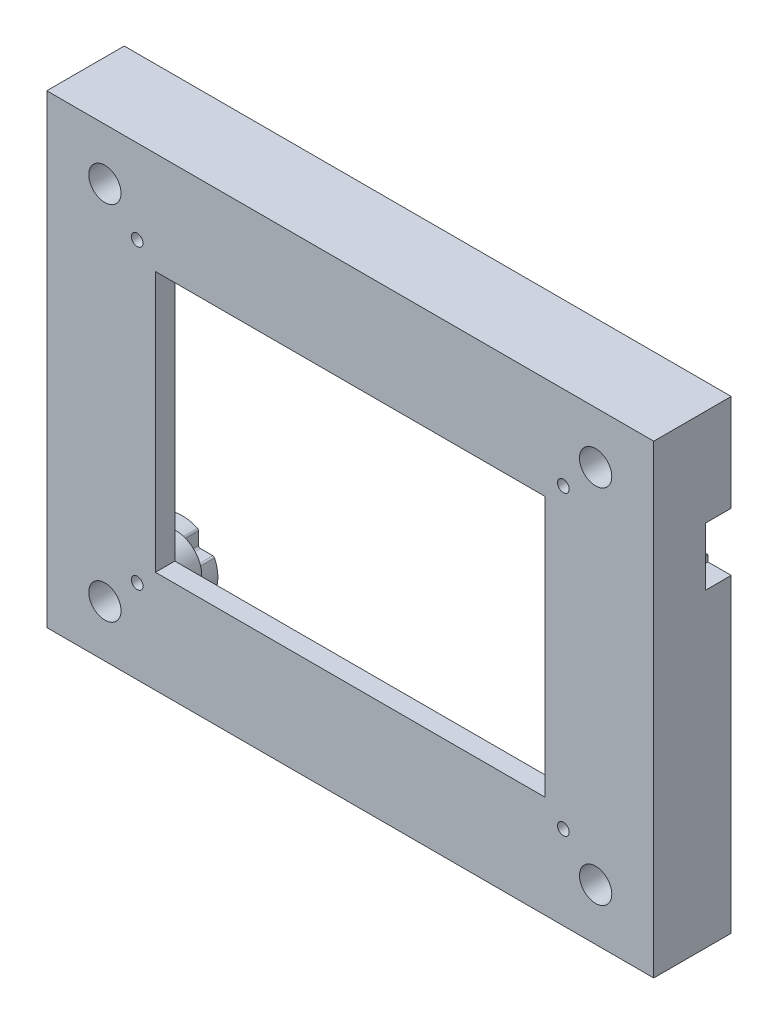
ISO-10303-21;
HEADER;
FILE_DESCRIPTION(('STEP AP214'),'2;1');
FILE_NAME('part.step','',(''),(''),'','','');
FILE_SCHEMA(('AUTOMOTIVE_DESIGN { 1 0 10303 214 1 1 1 1 }'));
ENDSEC;
DATA;
#1=APPLICATION_CONTEXT('core data for automotive mechanical design processes');
#2=APPLICATION_PROTOCOL_DEFINITION('international standard','automotive_design',2000,#1);
#3=PRODUCT_CONTEXT('',#1,'mechanical');
#4=PRODUCT('Part','Part','',(#3));
#5=PRODUCT_RELATED_PRODUCT_CATEGORY('part','',(#4));
#6=PRODUCT_DEFINITION_FORMATION('','',#4);
#7=PRODUCT_DEFINITION_CONTEXT('part definition',#1,'design');
#8=PRODUCT_DEFINITION('design','',#6,#7);
#9=PRODUCT_DEFINITION_SHAPE('','',#8);
#10=(LENGTH_UNIT() NAMED_UNIT(*) SI_UNIT(.MILLI.,.METRE.));
#11=(NAMED_UNIT(*) PLANE_ANGLE_UNIT() SI_UNIT($,.RADIAN.));
#12=(NAMED_UNIT(*) SI_UNIT($,.STERADIAN.) SOLID_ANGLE_UNIT());
#13=UNCERTAINTY_MEASURE_WITH_UNIT(LENGTH_MEASURE(1.E-05),#10,'distance_accuracy_value','');
#14=(GEOMETRIC_REPRESENTATION_CONTEXT(3) GLOBAL_UNCERTAINTY_ASSIGNED_CONTEXT((#13)) GLOBAL_UNIT_ASSIGNED_CONTEXT((#10,
#11,#12)) REPRESENTATION_CONTEXT('',''));
#15=CARTESIAN_POINT('',(0.,0.,0.));
#16=DIRECTION('',(0.,0.,1.));
#17=DIRECTION('',(1.,0.,0.));
#18=AXIS2_PLACEMENT_3D('',#15,#16,#17);
#19=CARTESIAN_POINT('',(-38.,-28.,12.));
#20=DIRECTION('',(0.,0.,-1.));
#21=DIRECTION('',(-1.,0.,0.));
#22=AXIS2_PLACEMENT_3D('',#19,#20,#21);
#23=CYLINDRICAL_SURFACE('',#22,5.49999999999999);
#24=CARTESIAN_POINT('',(-38.,-28.,9.));
#25=DIRECTION('',(0.,0.,1.));
#26=DIRECTION('',(1.,0.,0.));
#27=AXIS2_PLACEMENT_3D('',#24,#25,#26);
#28=CIRCLE('',#27,5.49999999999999);
#29=CARTESIAN_POINT('',(-34.2250827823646,-32.,9.));
#30=VERTEX_POINT('',#29);
#31=CARTESIAN_POINT('',(-32.5955046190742,-26.9794953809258,9.));
#32=VERTEX_POINT('',#31);
#33=EDGE_CURVE('E571',#30,#32,#28,.T.);
#34=ORIENTED_EDGE('',*,*,#33,.F.);
#35=DIRECTION('',(0.,0.,-1.));
#36=VECTOR('',#35,1.);
#37=CARTESIAN_POINT('',(-34.2250827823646,-32.,12.));
#38=LINE('',#37,#36);
#39=CARTESIAN_POINT('',(-34.2250827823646,-32.,0.));
#40=VERTEX_POINT('',#39);
#41=EDGE_CURVE('E772',#30,#40,#38,.T.);
#42=ORIENTED_EDGE('',*,*,#41,.T.);
#43=CARTESIAN_POINT('',(-38.,-28.,0.));
#44=DIRECTION('',(0.,0.,1.));
#45=DIRECTION('',(1.,0.,0.));
#46=AXIS2_PLACEMENT_3D('',#43,#44,#45);
#47=CIRCLE('',#46,5.49999999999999);
#48=CARTESIAN_POINT('',(-33.0164842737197,-25.6730769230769,0.));
#49=VERTEX_POINT('',#48);
#50=EDGE_CURVE('E719',#40,#49,#47,.T.);
#51=ORIENTED_EDGE('',*,*,#50,.T.);
#52=DIRECTION('',(0.,0.,-1.));
#53=VECTOR('',#52,1.);
#54=CARTESIAN_POINT('',(-33.0164842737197,-25.6730769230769,12.));
#55=LINE('',#54,#53);
#56=CARTESIAN_POINT('',(-33.0164842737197,-25.6730769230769,6.));
#57=VERTEX_POINT('',#56);
#58=EDGE_CURVE('E903',#49,#57,#55,.F.);
#59=ORIENTED_EDGE('',*,*,#58,.T.);
#60=CARTESIAN_POINT('',(-38.,-28.,6.));
#61=DIRECTION('',(0.,0.,1.));
#62=DIRECTION('',(1.,0.,0.));
#63=AXIS2_PLACEMENT_3D('',#60,#61,#62);
#64=CIRCLE('',#63,5.49999999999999);
#65=CARTESIAN_POINT('',(-32.5955046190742,-26.9794953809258,6.));
#66=VERTEX_POINT('',#65);
#67=EDGE_CURVE('E814',#66,#57,#64,.T.);
#68=ORIENTED_EDGE('',*,*,#67,.F.);
#69=DIRECTION('',(0.,0.,1.));
#70=VECTOR('',#69,1.);
#71=CARTESIAN_POINT('',(-32.5955046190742,-26.9794953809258,9.));
#72=LINE('',#71,#70);
#73=EDGE_CURVE('E640',#66,#32,#72,.T.);
#74=ORIENTED_EDGE('',*,*,#73,.T.);
#75=EDGE_LOOP('',(#34,#42,#51,#59,#68,#74));
#76=FACE_BOUND('',#75,.T.);
#77=ADVANCED_FACE('F35',(#76),#23,.T.);
#78=CARTESIAN_POINT('',(-38.,28.,12.));
#79=DIRECTION('',(0.,0.,-1.));
#80=DIRECTION('',(-1.,0.,0.));
#81=AXIS2_PLACEMENT_3D('',#78,#79,#80);
#82=CYLINDRICAL_SURFACE('',#81,5.5);
#83=CARTESIAN_POINT('',(-38.,28.,9.));
#84=DIRECTION('',(0.,0.,1.));
#85=DIRECTION('',(1.,0.,0.));
#86=AXIS2_PLACEMENT_3D('',#83,#84,#85);
#87=CIRCLE('',#86,5.5);
#88=CARTESIAN_POINT('',(-32.5955046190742,26.9794953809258,9.));
#89=VERTEX_POINT('',#88);
#90=CARTESIAN_POINT('',(-34.2250827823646,32.,9.));
#91=VERTEX_POINT('',#90);
#92=EDGE_CURVE('E563',#89,#91,#87,.T.);
#93=ORIENTED_EDGE('',*,*,#92,.F.);
#94=DIRECTION('',(0.,0.,1.));
#95=VECTOR('',#94,1.);
#96=CARTESIAN_POINT('',(-32.5955046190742,26.9794953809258,9.));
#97=LINE('',#96,#95);
#98=CARTESIAN_POINT('',(-32.5955046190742,26.9794953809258,6.));
#99=VERTEX_POINT('',#98);
#100=EDGE_CURVE('E630',#89,#99,#97,.F.);
#101=ORIENTED_EDGE('',*,*,#100,.T.);
#102=CARTESIAN_POINT('',(-38.,28.,6.));
#103=DIRECTION('',(0.,0.,1.));
#104=DIRECTION('',(1.,0.,0.));
#105=AXIS2_PLACEMENT_3D('',#102,#103,#104);
#106=CIRCLE('',#105,5.5);
#107=CARTESIAN_POINT('',(-33.0164842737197,25.6730769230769,6.));
#108=VERTEX_POINT('',#107);
#109=EDGE_CURVE('E817',#108,#99,#106,.T.);
#110=ORIENTED_EDGE('',*,*,#109,.F.);
#111=DIRECTION('',(0.,0.,-1.));
#112=VECTOR('',#111,1.);
#113=CARTESIAN_POINT('',(-33.0164842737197,25.6730769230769,12.));
#114=LINE('',#113,#112);
#115=CARTESIAN_POINT('',(-33.0164842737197,25.6730769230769,0.));
#116=VERTEX_POINT('',#115);
#117=EDGE_CURVE('E875',#108,#116,#114,.T.);
#118=ORIENTED_EDGE('',*,*,#117,.T.);
#119=CARTESIAN_POINT('',(-38.,28.,0.));
#120=DIRECTION('',(0.,0.,1.));
#121=DIRECTION('',(1.,0.,0.));
#122=AXIS2_PLACEMENT_3D('',#119,#120,#121);
#123=CIRCLE('',#122,5.5);
#124=CARTESIAN_POINT('',(-34.2250827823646,32.,0.));
#125=VERTEX_POINT('',#124);
#126=EDGE_CURVE('E725',#116,#125,#123,.T.);
#127=ORIENTED_EDGE('',*,*,#126,.T.);
#128=DIRECTION('',(0.,0.,-1.));
#129=VECTOR('',#128,1.);
#130=CARTESIAN_POINT('',(-34.2250827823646,32.,12.));
#131=LINE('',#130,#129);
#132=EDGE_CURVE('E785',#91,#125,#131,.T.);
#133=ORIENTED_EDGE('',*,*,#132,.F.);
#134=EDGE_LOOP('',(#93,#101,#110,#118,#127,#133));
#135=FACE_BOUND('',#134,.T.);
#136=ADVANCED_FACE('F1172',(#135),#82,.T.);
#137=CARTESIAN_POINT('',(38.,28.,12.));
#138=DIRECTION('',(0.,0.,-1.));
#139=DIRECTION('',(-1.,0.,0.));
#140=AXIS2_PLACEMENT_3D('',#137,#138,#139);
#141=CYLINDRICAL_SURFACE('',#140,5.49999999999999);
#142=CARTESIAN_POINT('',(38.,28.,9.));
#143=DIRECTION('',(0.,0.,1.));
#144=DIRECTION('',(1.,0.,0.));
#145=AXIS2_PLACEMENT_3D('',#142,#143,#144);
#146=CIRCLE('',#145,5.49999999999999);
#147=CARTESIAN_POINT('',(34.2250827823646,32.,9.));
#148=VERTEX_POINT('',#147);
#149=CARTESIAN_POINT('',(32.5955046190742,26.9794953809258,9.));
#150=VERTEX_POINT('',#149);
#151=EDGE_CURVE('E555',#148,#150,#146,.T.);
#152=ORIENTED_EDGE('',*,*,#151,.F.);
#153=DIRECTION('',(0.,0.,-1.));
#154=VECTOR('',#153,1.);
#155=CARTESIAN_POINT('',(34.2250827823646,32.,12.));
#156=LINE('',#155,#154);
#157=CARTESIAN_POINT('',(34.2250827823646,32.,0.));
#158=VERTEX_POINT('',#157);
#159=EDGE_CURVE('E783',#148,#158,#156,.T.);
#160=ORIENTED_EDGE('',*,*,#159,.T.);
#161=CARTESIAN_POINT('',(38.,28.,0.));
#162=DIRECTION('',(0.,0.,1.));
#163=DIRECTION('',(1.,0.,0.));
#164=AXIS2_PLACEMENT_3D('',#161,#162,#163);
#165=CIRCLE('',#164,5.49999999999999);
#166=CARTESIAN_POINT('',(33.0164842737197,25.6730769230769,0.));
#167=VERTEX_POINT('',#166);
#168=EDGE_CURVE('E733',#158,#167,#165,.T.);
#169=ORIENTED_EDGE('',*,*,#168,.T.);
#170=DIRECTION('',(0.,0.,-1.));
#171=VECTOR('',#170,1.);
#172=CARTESIAN_POINT('',(33.0164842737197,25.6730769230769,12.));
#173=LINE('',#172,#171);
#174=CARTESIAN_POINT('',(33.0164842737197,25.6730769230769,6.));
#175=VERTEX_POINT('',#174);
#176=EDGE_CURVE('E872',#167,#175,#173,.F.);
#177=ORIENTED_EDGE('',*,*,#176,.T.);
#178=CARTESIAN_POINT('',(38.,28.,6.));
#179=DIRECTION('',(0.,0.,1.));
#180=DIRECTION('',(1.,0.,0.));
#181=AXIS2_PLACEMENT_3D('',#178,#179,#180);
#182=CIRCLE('',#181,5.49999999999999);
#183=CARTESIAN_POINT('',(32.5955046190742,26.9794953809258,6.));
#184=VERTEX_POINT('',#183);
#185=EDGE_CURVE('E822',#184,#175,#182,.T.);
#186=ORIENTED_EDGE('',*,*,#185,.F.);
#187=DIRECTION('',(0.,0.,1.));
#188=VECTOR('',#187,1.);
#189=CARTESIAN_POINT('',(32.5955046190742,26.9794953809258,9.));
#190=LINE('',#189,#188);
#191=EDGE_CURVE('E624',#184,#150,#190,.T.);
#192=ORIENTED_EDGE('',*,*,#191,.T.);
#193=EDGE_LOOP('',(#152,#160,#169,#177,#186,#192));
#194=FACE_BOUND('',#193,.T.);
#195=ADVANCED_FACE('F1058',(#194),#141,.T.);
#196=CARTESIAN_POINT('',(38.,-28.,12.));
#197=DIRECTION('',(0.,0.,-1.));
#198=DIRECTION('',(-1.,0.,0.));
#199=AXIS2_PLACEMENT_3D('',#196,#197,#198);
#200=CYLINDRICAL_SURFACE('',#199,5.49999999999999);
#201=CARTESIAN_POINT('',(38.,-28.,9.));
#202=DIRECTION('',(0.,0.,1.));
#203=DIRECTION('',(1.,0.,0.));
#204=AXIS2_PLACEMENT_3D('',#201,#202,#203);
#205=CIRCLE('',#204,5.49999999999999);
#206=CARTESIAN_POINT('',(41.7777777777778,-24.0027015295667,9.));
#207=VERTEX_POINT('',#206);
#208=CARTESIAN_POINT('',(36.9794953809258,-22.5955046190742,9.));
#209=VERTEX_POINT('',#208);
#210=EDGE_CURVE('E579',#207,#209,#205,.T.);
#211=ORIENTED_EDGE('',*,*,#210,.F.);
#212=DIRECTION('',(0.,0.,-1.));
#213=VECTOR('',#212,1.);
#214=CARTESIAN_POINT('',(41.7777777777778,-24.0027015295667,12.));
#215=LINE('',#214,#213);
#216=CARTESIAN_POINT('',(41.7777777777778,-24.0027015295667,0.));
#217=VERTEX_POINT('',#216);
#218=EDGE_CURVE('E777',#207,#217,#215,.T.);
#219=ORIENTED_EDGE('',*,*,#218,.T.);
#220=CARTESIAN_POINT('',(38.,-28.,0.));
#221=DIRECTION('',(0.,0.,1.));
#222=DIRECTION('',(1.,0.,0.));
#223=AXIS2_PLACEMENT_3D('',#220,#221,#222);
#224=CIRCLE('',#223,5.49999999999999);
#225=CARTESIAN_POINT('',(35.6730769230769,-23.0164842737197,0.));
#226=VERTEX_POINT('',#225);
#227=EDGE_CURVE('E741',#217,#226,#224,.T.);
#228=ORIENTED_EDGE('',*,*,#227,.T.);
#229=DIRECTION('',(0.,0.,-1.));
#230=VECTOR('',#229,1.);
#231=CARTESIAN_POINT('',(35.6730769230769,-23.0164842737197,12.));
#232=LINE('',#231,#230);
#233=CARTESIAN_POINT('',(35.6730769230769,-23.0164842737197,6.));
#234=VERTEX_POINT('',#233);
#235=EDGE_CURVE('E855',#226,#234,#232,.F.);
#236=ORIENTED_EDGE('',*,*,#235,.T.);
#237=CARTESIAN_POINT('',(38.,-28.,6.));
#238=DIRECTION('',(0.,0.,1.));
#239=DIRECTION('',(1.,0.,0.));
#240=AXIS2_PLACEMENT_3D('',#237,#238,#239);
#241=CIRCLE('',#240,5.49999999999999);
#242=CARTESIAN_POINT('',(36.9794953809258,-22.5955046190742,6.));
#243=VERTEX_POINT('',#242);
#244=EDGE_CURVE('E810',#243,#234,#241,.T.);
#245=ORIENTED_EDGE('',*,*,#244,.F.);
#246=DIRECTION('',(0.,0.,1.));
#247=VECTOR('',#246,1.);
#248=CARTESIAN_POINT('',(36.9794953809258,-22.5955046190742,9.));
#249=LINE('',#248,#247);
#250=EDGE_CURVE('E648',#243,#209,#249,.T.);
#251=ORIENTED_EDGE('',*,*,#250,.T.);
#252=EDGE_LOOP('',(#211,#219,#228,#236,#245,#251));
#253=FACE_BOUND('',#252,.T.);
#254=ADVANCED_FACE('F1114',(#253),#200,.T.);
#255=CARTESIAN_POINT('',(0.,-32.,12.));
#256=DIRECTION('',(0.,1.,0.));
#257=DIRECTION('',(0.,0.,1.));
#258=AXIS2_PLACEMENT_3D('',#255,#256,#257);
#259=PLANE('',#258);
#260=DIRECTION('',(0.,0.,-1.));
#261=VECTOR('',#260,1.);
#262=CARTESIAN_POINT('',(41.7749172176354,-32.,12.));
#263=LINE('',#262,#261);
#264=CARTESIAN_POINT('',(41.7749172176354,-32.,9.));
#265=VERTEX_POINT('',#264);
#266=CARTESIAN_POINT('',(41.7749172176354,-32.,0.));
#267=VERTEX_POINT('',#266);
#268=EDGE_CURVE('E766',#265,#267,#263,.T.);
#269=ORIENTED_EDGE('',*,*,#268,.F.);
#270=DIRECTION('',(1.,0.,0.));
#271=VECTOR('',#270,1.);
#272=CARTESIAN_POINT('',(41.7777777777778,-32.,9.));
#273=LINE('',#272,#271);
#274=CARTESIAN_POINT('',(41.7777777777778,-32.,9.));
#275=VERTEX_POINT('',#274);
#276=EDGE_CURVE('E542',#265,#275,#273,.T.);
#277=ORIENTED_EDGE('',*,*,#276,.T.);
#278=DIRECTION('',(0.,0.,-1.));
#279=VECTOR('',#278,1.);
#280=CARTESIAN_POINT('',(41.7777777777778,-32.,12.));
#281=LINE('',#280,#279);
#282=CARTESIAN_POINT('',(41.7777777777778,-32.,0.));
#283=VERTEX_POINT('',#282);
#284=EDGE_CURVE('E761',#275,#283,#281,.T.);
#285=ORIENTED_EDGE('',*,*,#284,.T.);
#286=DIRECTION('',(1.,0.,0.));
#287=VECTOR('',#286,1.);
#288=CARTESIAN_POINT('',(0.,-32.,0.));
#289=LINE('',#288,#287);
#290=EDGE_CURVE('E753',#267,#283,#289,.T.);
#291=ORIENTED_EDGE('',*,*,#290,.F.);
#292=EDGE_LOOP('',(#269,#277,#285,#291));
#293=FACE_BOUND('',#292,.T.);
#294=ADVANCED_FACE('F1304',(#293),#259,.T.);
#295=CARTESIAN_POINT('',(38.,-28.,12.));
#296=DIRECTION('',(0.,0.,-1.));
#297=DIRECTION('',(-1.,0.,0.));
#298=AXIS2_PLACEMENT_3D('',#295,#296,#297);
#299=CYLINDRICAL_SURFACE('',#298,5.49999999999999);
#300=CARTESIAN_POINT('',(38.,-28.,9.));
#301=DIRECTION('',(0.,0.,1.));
#302=DIRECTION('',(1.,0.,0.));
#303=AXIS2_PLACEMENT_3D('',#300,#301,#302);
#304=CIRCLE('',#303,5.49999999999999);
#305=CARTESIAN_POINT('',(41.7777777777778,-31.9972984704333,9.));
#306=VERTEX_POINT('',#305);
#307=EDGE_CURVE('E584',#265,#306,#304,.T.);
#308=ORIENTED_EDGE('',*,*,#307,.F.);
#309=ORIENTED_EDGE('',*,*,#268,.T.);
#310=CARTESIAN_POINT('',(38.,-28.,0.));
#311=DIRECTION('',(0.,0.,1.));
#312=DIRECTION('',(1.,0.,0.));
#313=AXIS2_PLACEMENT_3D('',#310,#311,#312);
#314=CIRCLE('',#313,5.49999999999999);
#315=CARTESIAN_POINT('',(41.7777777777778,-31.9972984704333,0.));
#316=VERTEX_POINT('',#315);
#317=EDGE_CURVE('E756',#267,#316,#314,.T.);
#318=ORIENTED_EDGE('',*,*,#317,.T.);
#319=DIRECTION('',(0.,0.,-1.));
#320=VECTOR('',#319,1.);
#321=CARTESIAN_POINT('',(41.7777777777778,-31.9972984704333,12.));
#322=LINE('',#321,#320);
#323=EDGE_CURVE('E763',#306,#316,#322,.T.);
#324=ORIENTED_EDGE('',*,*,#323,.F.);
#325=EDGE_LOOP('',(#308,#309,#318,#324));
#326=FACE_BOUND('',#325,.T.);
#327=ADVANCED_FACE('F1308',(#326),#299,.T.);
#328=CARTESIAN_POINT('',(41.7777777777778,0.,12.));
#329=DIRECTION('',(1.,0.,0.));
#330=DIRECTION('',(0.,0.,-1.));
#331=AXIS2_PLACEMENT_3D('',#328,#329,#330);
#332=PLANE('',#331);
#333=DIRECTION('',(0.,1.,0.));
#334=VECTOR('',#333,1.);
#335=CARTESIAN_POINT('',(41.7777777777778,-32.,9.));
#336=LINE('',#335,#334);
#337=CARTESIAN_POINT('',(41.7777777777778,31.9972984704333,9.));
#338=VERTEX_POINT('',#337);
#339=CARTESIAN_POINT('',(41.7777777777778,32.,9.));
#340=VERTEX_POINT('',#339);
#341=EDGE_CURVE('E550',#338,#340,#336,.T.);
#342=ORIENTED_EDGE('',*,*,#341,.T.);
#343=DIRECTION('',(0.,0.,-1.));
#344=VECTOR('',#343,1.);
#345=CARTESIAN_POINT('',(41.7777777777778,32.,12.));
#346=LINE('',#345,#344);
#347=CARTESIAN_POINT('',(41.7777777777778,32.,0.));
#348=VERTEX_POINT('',#347);
#349=EDGE_CURVE('E769',#340,#348,#346,.T.);
#350=ORIENTED_EDGE('',*,*,#349,.T.);
#351=DIRECTION('',(0.,-1.,0.));
#352=VECTOR('',#351,1.);
#353=CARTESIAN_POINT('',(41.7777777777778,0.,0.));
#354=LINE('',#353,#352);
#355=CARTESIAN_POINT('',(41.7777777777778,31.9972984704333,0.));
#356=VERTEX_POINT('',#355);
#357=EDGE_CURVE('E744',#348,#356,#354,.T.);
#358=ORIENTED_EDGE('',*,*,#357,.T.);
#359=DIRECTION('',(0.,0.,-1.));
#360=VECTOR('',#359,1.);
#361=CARTESIAN_POINT('',(41.7777777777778,31.9972984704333,12.));
#362=LINE('',#361,#360);
#363=EDGE_CURVE('E764',#338,#356,#362,.T.);
#364=ORIENTED_EDGE('',*,*,#363,.F.);
#365=EDGE_LOOP('',(#342,#350,#358,#364));
#366=FACE_BOUND('',#365,.T.);
#367=ADVANCED_FACE('F1212',(#366),#332,.F.);
#368=CARTESIAN_POINT('',(38.,28.,12.));
#369=DIRECTION('',(0.,0.,-1.));
#370=DIRECTION('',(-1.,0.,0.));
#371=AXIS2_PLACEMENT_3D('',#368,#369,#370);
#372=CYLINDRICAL_SURFACE('',#371,5.49999999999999);
#373=CARTESIAN_POINT('',(38.,28.,9.));
#374=DIRECTION('',(0.,0.,1.));
#375=DIRECTION('',(1.,0.,0.));
#376=AXIS2_PLACEMENT_3D('',#373,#374,#375);
#377=CIRCLE('',#376,5.49999999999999);
#378=CARTESIAN_POINT('',(41.7749172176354,32.,9.));
#379=VERTEX_POINT('',#378);
#380=EDGE_CURVE('E581',#338,#379,#377,.T.);
#381=ORIENTED_EDGE('',*,*,#380,.F.);
#382=ORIENTED_EDGE('',*,*,#363,.T.);
#383=CARTESIAN_POINT('',(38.,28.,0.));
#384=DIRECTION('',(0.,0.,1.));
#385=DIRECTION('',(1.,0.,0.));
#386=AXIS2_PLACEMENT_3D('',#383,#384,#385);
#387=CIRCLE('',#386,5.49999999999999);
#388=CARTESIAN_POINT('',(41.7749172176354,32.,0.));
#389=VERTEX_POINT('',#388);
#390=EDGE_CURVE('E747',#356,#389,#387,.T.);
#391=ORIENTED_EDGE('',*,*,#390,.T.);
#392=DIRECTION('',(0.,0.,-1.));
#393=VECTOR('',#392,1.);
#394=CARTESIAN_POINT('',(41.7749172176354,32.,12.));
#395=LINE('',#394,#393);
#396=EDGE_CURVE('E771',#379,#389,#395,.T.);
#397=ORIENTED_EDGE('',*,*,#396,.F.);
#398=EDGE_LOOP('',(#381,#382,#391,#397));
#399=FACE_BOUND('',#398,.T.);
#400=ADVANCED_FACE('F1208',(#399),#372,.T.);
#401=CARTESIAN_POINT('',(0.,-32.,12.));
#402=DIRECTION('',(0.,1.,0.));
#403=DIRECTION('',(0.,0.,1.));
#404=AXIS2_PLACEMENT_3D('',#401,#402,#403);
#405=PLANE('',#404);
#406=ORIENTED_EDGE('',*,*,#41,.F.);
#407=CARTESIAN_POINT('',(34.2250827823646,-32.,9.));
#408=VERTEX_POINT('',#407);
#409=EDGE_CURVE('E545',#30,#408,#273,.T.);
#410=ORIENTED_EDGE('',*,*,#409,.T.);
#411=DIRECTION('',(0.,0.,-1.));
#412=VECTOR('',#411,1.);
#413=CARTESIAN_POINT('',(34.2250827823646,-32.,12.));
#414=LINE('',#413,#412);
#415=CARTESIAN_POINT('',(34.2250827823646,-32.,0.));
#416=VERTEX_POINT('',#415);
#417=EDGE_CURVE('E775',#408,#416,#414,.T.);
#418=ORIENTED_EDGE('',*,*,#417,.T.);
#419=DIRECTION('',(1.,0.,0.));
#420=VECTOR('',#419,1.);
#421=CARTESIAN_POINT('',(0.,-32.,0.));
#422=LINE('',#421,#420);
#423=EDGE_CURVE('E715',#40,#416,#422,.T.);
#424=ORIENTED_EDGE('',*,*,#423,.F.);
#425=EDGE_LOOP('',(#406,#410,#418,#424));
#426=FACE_BOUND('',#425,.T.);
#427=ADVANCED_FACE('F967',(#426),#405,.T.);
#428=CARTESIAN_POINT('',(-38.,-28.,9.));
#429=DIRECTION('',(0.,0.,1.));
#430=DIRECTION('',(1.,0.,0.));
#431=AXIS2_PLACEMENT_3D('',#428,#429,#430);
#432=CIRCLE('',#431,5.49999999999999);
#433=CARTESIAN_POINT('',(-36.9794953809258,-22.5955046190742,9.));
#434=VERTEX_POINT('',#433);
#435=CARTESIAN_POINT('',(-41.7777777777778,-24.0027015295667,9.));
#436=VERTEX_POINT('',#435);
#437=EDGE_CURVE('E569',#434,#436,#432,.T.);
#438=ORIENTED_EDGE('',*,*,#437,.F.);
#439=DIRECTION('',(0.,0.,1.));
#440=VECTOR('',#439,1.);
#441=CARTESIAN_POINT('',(-36.9794953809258,-22.5955046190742,9.));
#442=LINE('',#441,#440);
#443=CARTESIAN_POINT('',(-36.9794953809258,-22.5955046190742,6.));
#444=VERTEX_POINT('',#443);
#445=EDGE_CURVE('E638',#434,#444,#442,.F.);
#446=ORIENTED_EDGE('',*,*,#445,.T.);
#447=CARTESIAN_POINT('',(-35.6730769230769,-23.0164842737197,6.));
#448=VERTEX_POINT('',#447);
#449=EDGE_CURVE('E813',#448,#444,#64,.T.);
#450=ORIENTED_EDGE('',*,*,#449,.F.);
#451=DIRECTION('',(0.,0.,-1.));
#452=VECTOR('',#451,1.);
#453=CARTESIAN_POINT('',(-35.6730769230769,-23.0164842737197,12.));
#454=LINE('',#453,#452);
#455=CARTESIAN_POINT('',(-35.6730769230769,-23.0164842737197,0.));
#456=VERTEX_POINT('',#455);
#457=EDGE_CURVE('E906',#448,#456,#454,.T.);
#458=ORIENTED_EDGE('',*,*,#457,.T.);
#459=CARTESIAN_POINT('',(-41.7777777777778,-24.0027015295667,0.));
#460=VERTEX_POINT('',#459);
#461=EDGE_CURVE('E718',#456,#460,#47,.T.);
#462=ORIENTED_EDGE('',*,*,#461,.T.);
#463=DIRECTION('',(0.,0.,-1.));
#464=VECTOR('',#463,1.);
#465=CARTESIAN_POINT('',(-41.7777777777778,-24.0027015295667,12.));
#466=LINE('',#465,#464);
#467=EDGE_CURVE('E789',#436,#460,#466,.T.);
#468=ORIENTED_EDGE('',*,*,#467,.F.);
#469=EDGE_LOOP('',(#438,#446,#450,#458,#462,#468));
#470=FACE_BOUND('',#469,.T.);
#471=ADVANCED_FACE('F1014',(#470),#23,.T.);
#472=CARTESIAN_POINT('',(-41.7777777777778,0.,12.));
#473=DIRECTION('',(1.,0.,0.));
#474=DIRECTION('',(0.,0.,-1.));
#475=AXIS2_PLACEMENT_3D('',#472,#473,#474);
#476=PLANE('',#475);
#477=DIRECTION('',(0.,0.,-1.));
#478=VECTOR('',#477,1.);
#479=CARTESIAN_POINT('',(-41.7777777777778,24.0027015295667,12.));
#480=LINE('',#479,#478);
#481=CARTESIAN_POINT('',(-41.7777777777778,24.0027015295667,9.));
#482=VERTEX_POINT('',#481);
#483=CARTESIAN_POINT('',(-41.7777777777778,24.0027015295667,0.));
#484=VERTEX_POINT('',#483);
#485=EDGE_CURVE('E787',#482,#484,#480,.T.);
#486=ORIENTED_EDGE('',*,*,#485,.F.);
#487=DIRECTION('',(0.,-1.,0.));
#488=VECTOR('',#487,1.);
#489=CARTESIAN_POINT('',(-41.7777777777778,-32.,9.));
#490=LINE('',#489,#488);
#491=EDGE_CURVE('E533',#482,#436,#490,.T.);
#492=ORIENTED_EDGE('',*,*,#491,.T.);
#493=ORIENTED_EDGE('',*,*,#467,.T.);
#494=DIRECTION('',(0.,-1.,0.));
#495=VECTOR('',#494,1.);
#496=CARTESIAN_POINT('',(-41.7777777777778,0.,0.));
#497=LINE('',#496,#495);
#498=EDGE_CURVE('E722',#484,#460,#497,.T.);
#499=ORIENTED_EDGE('',*,*,#498,.F.);
#500=EDGE_LOOP('',(#486,#492,#493,#499));
#501=FACE_BOUND('',#500,.T.);
#502=ADVANCED_FACE('F1020',(#501),#476,.T.);
#503=CARTESIAN_POINT('',(-38.,28.,9.));
#504=DIRECTION('',(0.,0.,1.));
#505=DIRECTION('',(1.,0.,0.));
#506=AXIS2_PLACEMENT_3D('',#503,#504,#505);
#507=CIRCLE('',#506,5.5);
#508=CARTESIAN_POINT('',(-36.9794953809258,22.5955046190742,9.));
#509=VERTEX_POINT('',#508);
#510=EDGE_CURVE('E561',#482,#509,#507,.T.);
#511=ORIENTED_EDGE('',*,*,#510,.F.);
#512=ORIENTED_EDGE('',*,*,#485,.T.);
#513=CARTESIAN_POINT('',(-35.6730769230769,23.0164842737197,0.));
#514=VERTEX_POINT('',#513);
#515=EDGE_CURVE('E726',#484,#514,#123,.T.);
#516=ORIENTED_EDGE('',*,*,#515,.T.);
#517=DIRECTION('',(0.,0.,-1.));
#518=VECTOR('',#517,1.);
#519=CARTESIAN_POINT('',(-35.6730769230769,23.0164842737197,12.));
#520=LINE('',#519,#518);
#521=CARTESIAN_POINT('',(-35.6730769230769,23.0164842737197,6.));
#522=VERTEX_POINT('',#521);
#523=EDGE_CURVE('E883',#514,#522,#520,.F.);
#524=ORIENTED_EDGE('',*,*,#523,.T.);
#525=CARTESIAN_POINT('',(-36.9794953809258,22.5955046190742,6.));
#526=VERTEX_POINT('',#525);
#527=EDGE_CURVE('E818',#526,#522,#106,.T.);
#528=ORIENTED_EDGE('',*,*,#527,.F.);
#529=DIRECTION('',(0.,0.,1.));
#530=VECTOR('',#529,1.);
#531=CARTESIAN_POINT('',(-36.9794953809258,22.5955046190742,9.));
#532=LINE('',#531,#530);
#533=EDGE_CURVE('E632',#526,#509,#532,.T.);
#534=ORIENTED_EDGE('',*,*,#533,.T.);
#535=EDGE_LOOP('',(#511,#512,#516,#524,#528,#534));
#536=FACE_BOUND('',#535,.T.);
#537=ADVANCED_FACE('F1179',(#536),#82,.T.);
#538=CARTESIAN_POINT('',(0.,32.,12.));
#539=DIRECTION('',(0.,1.,0.));
#540=DIRECTION('',(-1.,0.,0.));
#541=AXIS2_PLACEMENT_3D('',#538,#539,#540);
#542=PLANE('',#541);
#543=DIRECTION('',(-1.,0.,0.));
#544=VECTOR('',#543,1.);
#545=CARTESIAN_POINT('',(41.7777777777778,32.,9.));
#546=LINE('',#545,#544);
#547=EDGE_CURVE('E548',#148,#91,#546,.T.);
#548=ORIENTED_EDGE('',*,*,#547,.T.);
#549=ORIENTED_EDGE('',*,*,#132,.T.);
#550=DIRECTION('',(1.,0.,0.));
#551=VECTOR('',#550,1.);
#552=CARTESIAN_POINT('',(0.,32.,0.));
#553=LINE('',#552,#551);
#554=EDGE_CURVE('E729',#125,#158,#553,.T.);
#555=ORIENTED_EDGE('',*,*,#554,.T.);
#556=ORIENTED_EDGE('',*,*,#159,.F.);
#557=EDGE_LOOP('',(#548,#549,#555,#556));
#558=FACE_BOUND('',#557,.T.);
#559=ADVANCED_FACE('F1062',(#558),#542,.F.);
#560=CARTESIAN_POINT('',(38.,28.,9.));
#561=DIRECTION('',(0.,0.,1.));
#562=DIRECTION('',(1.,0.,0.));
#563=AXIS2_PLACEMENT_3D('',#560,#561,#562);
#564=CIRCLE('',#563,5.49999999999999);
#565=CARTESIAN_POINT('',(36.9794953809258,22.5955046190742,9.));
#566=VERTEX_POINT('',#565);
#567=CARTESIAN_POINT('',(41.7777777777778,24.0027015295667,9.));
#568=VERTEX_POINT('',#567);
#569=EDGE_CURVE('E553',#566,#568,#564,.T.);
#570=ORIENTED_EDGE('',*,*,#569,.F.);
#571=DIRECTION('',(0.,0.,1.));
#572=VECTOR('',#571,1.);
#573=CARTESIAN_POINT('',(36.9794953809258,22.5955046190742,9.));
#574=LINE('',#573,#572);
#575=CARTESIAN_POINT('',(36.9794953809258,22.5955046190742,6.));
#576=VERTEX_POINT('',#575);
#577=EDGE_CURVE('E622',#566,#576,#574,.F.);
#578=ORIENTED_EDGE('',*,*,#577,.T.);
#579=CARTESIAN_POINT('',(35.6730769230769,23.0164842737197,6.));
#580=VERTEX_POINT('',#579);
#581=EDGE_CURVE('E821',#580,#576,#182,.T.);
#582=ORIENTED_EDGE('',*,*,#581,.F.);
#583=DIRECTION('',(0.,0.,-1.));
#584=VECTOR('',#583,1.);
#585=CARTESIAN_POINT('',(35.6730769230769,23.0164842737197,12.));
#586=LINE('',#585,#584);
#587=CARTESIAN_POINT('',(35.6730769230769,23.0164842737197,0.));
#588=VERTEX_POINT('',#587);
#589=EDGE_CURVE('E858',#580,#588,#586,.T.);
#590=ORIENTED_EDGE('',*,*,#589,.T.);
#591=CARTESIAN_POINT('',(41.7777777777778,24.0027015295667,0.));
#592=VERTEX_POINT('',#591);
#593=EDGE_CURVE('E732',#588,#592,#165,.T.);
#594=ORIENTED_EDGE('',*,*,#593,.T.);
#595=DIRECTION('',(0.,0.,-1.));
#596=VECTOR('',#595,1.);
#597=CARTESIAN_POINT('',(41.7777777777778,24.0027015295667,12.));
#598=LINE('',#597,#596);
#599=EDGE_CURVE('E781',#568,#592,#598,.T.);
#600=ORIENTED_EDGE('',*,*,#599,.F.);
#601=EDGE_LOOP('',(#570,#578,#582,#590,#594,#600));
#602=FACE_BOUND('',#601,.T.);
#603=ADVANCED_FACE('F948',(#602),#141,.T.);
#604=CARTESIAN_POINT('',(41.7777777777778,0.,12.));
#605=DIRECTION('',(1.,0.,0.));
#606=DIRECTION('',(0.,0.,-1.));
#607=AXIS2_PLACEMENT_3D('',#604,#605,#606);
#608=PLANE('',#607);
#609=DIRECTION('',(0.,-1.,0.));
#610=VECTOR('',#609,1.);
#611=CARTESIAN_POINT('',(41.7777777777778,0.,3.));
#612=LINE('',#611,#610);
#613=CARTESIAN_POINT('',(41.7777777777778,20.,3.));
#614=VERTEX_POINT('',#613);
#615=CARTESIAN_POINT('',(41.7777777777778,13.,3.));
#616=VERTEX_POINT('',#615);
#617=EDGE_CURVE('E434',#614,#616,#612,.T.);
#618=ORIENTED_EDGE('',*,*,#617,.T.);
#619=DIRECTION('',(0.,0.,-1.));
#620=VECTOR('',#619,1.);
#621=CARTESIAN_POINT('',(41.7777777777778,13.,12.));
#622=LINE('',#621,#620);
#623=CARTESIAN_POINT('',(41.7777777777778,13.,0.));
#624=VERTEX_POINT('',#623);
#625=EDGE_CURVE('E455',#616,#624,#622,.T.);
#626=ORIENTED_EDGE('',*,*,#625,.T.);
#627=DIRECTION('',(0.,-1.,0.));
#628=VECTOR('',#627,1.);
#629=CARTESIAN_POINT('',(41.7777777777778,0.,0.));
#630=LINE('',#629,#628);
#631=EDGE_CURVE('E736',#624,#217,#630,.T.);
#632=ORIENTED_EDGE('',*,*,#631,.T.);
#633=ORIENTED_EDGE('',*,*,#218,.F.);
#634=EDGE_CURVE('E549',#207,#568,#336,.T.);
#635=ORIENTED_EDGE('',*,*,#634,.T.);
#636=ORIENTED_EDGE('',*,*,#599,.T.);
#637=CARTESIAN_POINT('',(41.7777777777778,20.,0.));
#638=VERTEX_POINT('',#637);
#639=EDGE_CURVE('E737',#592,#638,#630,.T.);
#640=ORIENTED_EDGE('',*,*,#639,.T.);
#641=DIRECTION('',(0.,0.,1.));
#642=VECTOR('',#641,1.);
#643=CARTESIAN_POINT('',(41.7777777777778,20.,12.));
#644=LINE('',#643,#642);
#645=EDGE_CURVE('E450',#638,#614,#644,.T.);
#646=ORIENTED_EDGE('',*,*,#645,.T.);
#647=EDGE_LOOP('',(#618,#626,#632,#633,#635,#636,#640,#646));
#648=FACE_BOUND('',#647,.T.);
#649=ADVANCED_FACE('F955',(#648),#608,.F.);
#650=CARTESIAN_POINT('',(0.,32.,12.));
#651=DIRECTION('',(0.,1.,0.));
#652=DIRECTION('',(0.,0.,1.));
#653=AXIS2_PLACEMENT_3D('',#650,#651,#652);
#654=PLANE('',#653);
#655=EDGE_CURVE('E551',#340,#379,#546,.T.);
#656=ORIENTED_EDGE('',*,*,#655,.T.);
#657=ORIENTED_EDGE('',*,*,#396,.T.);
#658=DIRECTION('',(1.,0.,0.));
#659=VECTOR('',#658,1.);
#660=CARTESIAN_POINT('',(0.,32.,0.));
#661=LINE('',#660,#659);
#662=EDGE_CURVE('E750',#389,#348,#661,.T.);
#663=ORIENTED_EDGE('',*,*,#662,.T.);
#664=ORIENTED_EDGE('',*,*,#349,.F.);
#665=EDGE_LOOP('',(#656,#657,#663,#664));
#666=FACE_BOUND('',#665,.T.);
#667=ADVANCED_FACE('F1321',(#666),#654,.F.);
#668=CARTESIAN_POINT('',(38.,-28.,9.));
#669=DIRECTION('',(0.,0.,1.));
#670=DIRECTION('',(1.,0.,0.));
#671=AXIS2_PLACEMENT_3D('',#668,#669,#670);
#672=CIRCLE('',#671,5.49999999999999);
#673=CARTESIAN_POINT('',(32.5955046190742,-26.9794953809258,9.));
#674=VERTEX_POINT('',#673);
#675=EDGE_CURVE('E577',#674,#408,#672,.T.);
#676=ORIENTED_EDGE('',*,*,#675,.F.);
#677=DIRECTION('',(0.,0.,1.));
#678=VECTOR('',#677,1.);
#679=CARTESIAN_POINT('',(32.5955046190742,-26.9794953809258,9.));
#680=LINE('',#679,#678);
#681=CARTESIAN_POINT('',(32.5955046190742,-26.9794953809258,6.));
#682=VERTEX_POINT('',#681);
#683=EDGE_CURVE('E646',#674,#682,#680,.F.);
#684=ORIENTED_EDGE('',*,*,#683,.T.);
#685=CARTESIAN_POINT('',(33.0164842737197,-25.6730769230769,6.));
#686=VERTEX_POINT('',#685);
#687=EDGE_CURVE('E768',#686,#682,#241,.T.);
#688=ORIENTED_EDGE('',*,*,#687,.F.);
#689=DIRECTION('',(0.,0.,-1.));
#690=VECTOR('',#689,1.);
#691=CARTESIAN_POINT('',(33.0164842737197,-25.6730769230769,12.));
#692=LINE('',#691,#690);
#693=CARTESIAN_POINT('',(33.0164842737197,-25.6730769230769,0.));
#694=VERTEX_POINT('',#693);
#695=EDGE_CURVE('E825',#686,#694,#692,.T.);
#696=ORIENTED_EDGE('',*,*,#695,.T.);
#697=EDGE_CURVE('E740',#694,#416,#224,.T.);
#698=ORIENTED_EDGE('',*,*,#697,.T.);
#699=ORIENTED_EDGE('',*,*,#417,.F.);
#700=EDGE_LOOP('',(#676,#684,#688,#696,#698,#699));
#701=FACE_BOUND('',#700,.T.);
#702=ADVANCED_FACE('F974',(#701),#200,.T.);
#703=CARTESIAN_POINT('',(41.7777777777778,0.,12.));
#704=DIRECTION('',(1.,0.,0.));
#705=DIRECTION('',(0.,0.,-1.));
#706=AXIS2_PLACEMENT_3D('',#703,#704,#705);
#707=PLANE('',#706);
#708=EDGE_CURVE('E546',#275,#306,#336,.T.);
#709=ORIENTED_EDGE('',*,*,#708,.T.);
#710=ORIENTED_EDGE('',*,*,#323,.T.);
#711=DIRECTION('',(0.,-1.,0.));
#712=VECTOR('',#711,1.);
#713=CARTESIAN_POINT('',(41.7777777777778,0.,0.));
#714=LINE('',#713,#712);
#715=EDGE_CURVE('E680',#316,#283,#714,.T.);
#716=ORIENTED_EDGE('',*,*,#715,.T.);
#717=ORIENTED_EDGE('',*,*,#284,.F.);
#718=EDGE_LOOP('',(#709,#710,#716,#717));
#719=FACE_BOUND('',#718,.T.);
#720=ADVANCED_FACE('F1313',(#719),#707,.F.);
#721=CARTESIAN_POINT('',(33.,-23.,6.));
#722=DIRECTION('',(0.,0.,1.));
#723=DIRECTION('',(1.,0.,0.));
#724=AXIS2_PLACEMENT_3D('',#721,#722,#723);
#725=CYLINDRICAL_SURFACE('',#724,4.);
#726=CARTESIAN_POINT('',(33.,-23.,9.));
#727=DIRECTION('',(0.,0.,1.));
#728=DIRECTION('',(1.,0.,0.));
#729=AXIS2_PLACEMENT_3D('',#726,#727,#728);
#730=CIRCLE('',#729,4.);
#731=CARTESIAN_POINT('',(30.1715728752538,-20.1715728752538,9.));
#732=VERTEX_POINT('',#731);
#733=EDGE_CURVE('E573',#674,#732,#730,.F.);
#734=ORIENTED_EDGE('',*,*,#733,.T.);
#735=EDGE_CURVE('E576',#732,#209,#730,.F.);
#736=ORIENTED_EDGE('',*,*,#735,.T.);
#737=ORIENTED_EDGE('',*,*,#250,.F.);
#738=CARTESIAN_POINT('',(33.,-23.,6.));
#739=DIRECTION('',(0.,0.,1.));
#740=DIRECTION('',(1.,0.,0.));
#741=AXIS2_PLACEMENT_3D('',#738,#739,#740);
#742=CIRCLE('',#741,4.);
#743=EDGE_CURVE('E643',#243,#682,#742,.T.);
#744=ORIENTED_EDGE('',*,*,#743,.T.);
#745=ORIENTED_EDGE('',*,*,#683,.F.);
#746=EDGE_LOOP('',(#734,#736,#737,#744,#745));
#747=FACE_BOUND('',#746,.T.);
#748=ADVANCED_FACE('F1129',(#747),#725,.T.);
#749=CARTESIAN_POINT('',(-33.,-23.,6.));
#750=DIRECTION('',(0.,0.,1.));
#751=DIRECTION('',(1.,0.,0.));
#752=AXIS2_PLACEMENT_3D('',#749,#750,#751);
#753=CYLINDRICAL_SURFACE('',#752,4.);
#754=CARTESIAN_POINT('',(-33.,-23.,9.));
#755=DIRECTION('',(0.,0.,1.));
#756=DIRECTION('',(1.,0.,0.));
#757=AXIS2_PLACEMENT_3D('',#754,#755,#756);
#758=CIRCLE('',#757,4.);
#759=CARTESIAN_POINT('',(-30.1715728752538,-20.1715728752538,9.));
#760=VERTEX_POINT('',#759);
#761=EDGE_CURVE('E565',#434,#760,#758,.F.);
#762=ORIENTED_EDGE('',*,*,#761,.T.);
#763=EDGE_CURVE('E568',#760,#32,#758,.F.);
#764=ORIENTED_EDGE('',*,*,#763,.T.);
#765=ORIENTED_EDGE('',*,*,#73,.F.);
#766=CARTESIAN_POINT('',(-33.,-23.,6.));
#767=DIRECTION('',(0.,0.,1.));
#768=DIRECTION('',(1.,0.,0.));
#769=AXIS2_PLACEMENT_3D('',#766,#767,#768);
#770=CIRCLE('',#769,4.);
#771=EDGE_CURVE('E635',#66,#444,#770,.T.);
#772=ORIENTED_EDGE('',*,*,#771,.T.);
#773=ORIENTED_EDGE('',*,*,#445,.F.);
#774=EDGE_LOOP('',(#762,#764,#765,#772,#773));
#775=FACE_BOUND('',#774,.T.);
#776=ADVANCED_FACE('F1024',(#775),#753,.T.);
#777=CARTESIAN_POINT('',(-33.,23.,6.));
#778=DIRECTION('',(0.,0.,1.));
#779=DIRECTION('',(1.,0.,0.));
#780=AXIS2_PLACEMENT_3D('',#777,#778,#779);
#781=CYLINDRICAL_SURFACE('',#780,4.);
#782=CARTESIAN_POINT('',(-33.,23.,9.));
#783=DIRECTION('',(0.,0.,1.));
#784=DIRECTION('',(1.,0.,0.));
#785=AXIS2_PLACEMENT_3D('',#782,#783,#784);
#786=CIRCLE('',#785,4.);
#787=CARTESIAN_POINT('',(-30.1715728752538,20.1715728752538,9.));
#788=VERTEX_POINT('',#787);
#789=EDGE_CURVE('E557',#89,#788,#786,.F.);
#790=ORIENTED_EDGE('',*,*,#789,.T.);
#791=EDGE_CURVE('E560',#788,#509,#786,.F.);
#792=ORIENTED_EDGE('',*,*,#791,.T.);
#793=ORIENTED_EDGE('',*,*,#533,.F.);
#794=CARTESIAN_POINT('',(-33.,23.,6.));
#795=DIRECTION('',(0.,0.,1.));
#796=DIRECTION('',(1.,0.,0.));
#797=AXIS2_PLACEMENT_3D('',#794,#795,#796);
#798=CIRCLE('',#797,4.);
#799=EDGE_CURVE('E627',#526,#99,#798,.T.);
#800=ORIENTED_EDGE('',*,*,#799,.T.);
#801=ORIENTED_EDGE('',*,*,#100,.F.);
#802=EDGE_LOOP('',(#790,#792,#793,#800,#801));
#803=FACE_BOUND('',#802,.T.);
#804=ADVANCED_FACE('F1177',(#803),#781,.T.);
#805=CARTESIAN_POINT('',(33.,23.,6.));
#806=DIRECTION('',(0.,0.,1.));
#807=DIRECTION('',(1.,0.,0.));
#808=AXIS2_PLACEMENT_3D('',#805,#806,#807);
#809=CYLINDRICAL_SURFACE('',#808,4.);
#810=CARTESIAN_POINT('',(33.,23.,9.));
#811=DIRECTION('',(0.,0.,1.));
#812=DIRECTION('',(1.,0.,0.));
#813=AXIS2_PLACEMENT_3D('',#810,#811,#812);
#814=CIRCLE('',#813,4.);
#815=CARTESIAN_POINT('',(30.1715728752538,20.1715728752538,9.));
#816=VERTEX_POINT('',#815);
#817=EDGE_CURVE('E39',#566,#816,#814,.F.);
#818=ORIENTED_EDGE('',*,*,#817,.T.);
#819=EDGE_CURVE('E11',#816,#150,#814,.F.);
#820=ORIENTED_EDGE('',*,*,#819,.T.);
#821=ORIENTED_EDGE('',*,*,#191,.F.);
#822=CARTESIAN_POINT('',(33.,23.,6.));
#823=DIRECTION('',(0.,0.,1.));
#824=DIRECTION('',(1.,0.,0.));
#825=AXIS2_PLACEMENT_3D('',#822,#823,#824);
#826=CIRCLE('',#825,4.);
#827=EDGE_CURVE('E611',#184,#576,#826,.T.);
#828=ORIENTED_EDGE('',*,*,#827,.T.);
#829=ORIENTED_EDGE('',*,*,#577,.F.);
#830=EDGE_LOOP('',(#818,#820,#821,#828,#829));
#831=FACE_BOUND('',#830,.T.);
#832=ADVANCED_FACE('F938',(#831),#809,.T.);
#833=CARTESIAN_POINT('',(-38.,28.,12.));
#834=DIRECTION('',(0.,0.,-1.));
#835=DIRECTION('',(-1.,0.,0.));
#836=AXIS2_PLACEMENT_3D('',#833,#834,#835);
#837=CYLINDRICAL_SURFACE('',#836,1.65);
#838=CARTESIAN_POINT('',(-38.,28.,0.));
#839=DIRECTION('',(0.,0.,1.));
#840=DIRECTION('',(1.,0.,0.));
#841=AXIS2_PLACEMENT_3D('',#838,#839,#840);
#842=CIRCLE('',#841,1.65);
#843=CARTESIAN_POINT('',(-36.35,28.,0.));
#844=VERTEX_POINT('',#843);
#845=EDGE_CURVE('E699',#844,#844,#842,.T.);
#846=ORIENTED_EDGE('',*,*,#845,.F.);
#847=EDGE_LOOP('',(#846));
#848=FACE_BOUND('',#847,.T.);
#849=CARTESIAN_POINT('',(-38.,28.,4.5));
#850=DIRECTION('',(0.,0.,1.));
#851=DIRECTION('',(1.,0.,0.));
#852=AXIS2_PLACEMENT_3D('',#849,#850,#851);
#853=CIRCLE('',#852,1.65);
#854=CARTESIAN_POINT('',(-36.35,28.,4.5));
#855=VERTEX_POINT('',#854);
#856=EDGE_CURVE('E693',#855,#855,#853,.T.);
#857=ORIENTED_EDGE('',*,*,#856,.T.);
#858=EDGE_LOOP('',(#857));
#859=FACE_BOUND('',#858,.T.);
#860=ADVANCED_FACE('F1233',(#848,#859),#837,.F.);
#861=CARTESIAN_POINT('',(-38.,-28.,12.));
#862=DIRECTION('',(0.,0.,-1.));
#863=DIRECTION('',(-1.,0.,0.));
#864=AXIS2_PLACEMENT_3D('',#861,#862,#863);
#865=CYLINDRICAL_SURFACE('',#864,1.65);
#866=CARTESIAN_POINT('',(-38.,-28.,0.));
#867=DIRECTION('',(0.,0.,1.));
#868=DIRECTION('',(1.,0.,0.));
#869=AXIS2_PLACEMENT_3D('',#866,#867,#868);
#870=CIRCLE('',#869,1.65);
#871=CARTESIAN_POINT('',(-36.35,-28.,0.));
#872=VERTEX_POINT('',#871);
#873=EDGE_CURVE('E696',#872,#872,#870,.T.);
#874=ORIENTED_EDGE('',*,*,#873,.F.);
#875=EDGE_LOOP('',(#874));
#876=FACE_BOUND('',#875,.T.);
#877=CARTESIAN_POINT('',(-38.,-28.,4.5));
#878=DIRECTION('',(0.,0.,1.));
#879=DIRECTION('',(1.,0.,0.));
#880=AXIS2_PLACEMENT_3D('',#877,#878,#879);
#881=CIRCLE('',#880,1.65);
#882=CARTESIAN_POINT('',(-36.35,-28.,4.5));
#883=VERTEX_POINT('',#882);
#884=EDGE_CURVE('E805',#883,#883,#881,.T.);
#885=ORIENTED_EDGE('',*,*,#884,.T.);
#886=EDGE_LOOP('',(#885));
#887=FACE_BOUND('',#886,.T.);
#888=ADVANCED_FACE('F1236',(#876,#887),#865,.F.);
#889=CARTESIAN_POINT('',(38.,28.,12.));
#890=DIRECTION('',(0.,0.,-1.));
#891=DIRECTION('',(-1.,0.,0.));
#892=AXIS2_PLACEMENT_3D('',#889,#890,#891);
#893=CYLINDRICAL_SURFACE('',#892,1.65);
#894=CARTESIAN_POINT('',(38.,28.,0.));
#895=DIRECTION('',(0.,0.,1.));
#896=DIRECTION('',(1.,0.,0.));
#897=AXIS2_PLACEMENT_3D('',#894,#895,#896);
#898=CIRCLE('',#897,1.65);
#899=CARTESIAN_POINT('',(39.65,28.,0.));
#900=VERTEX_POINT('',#899);
#901=EDGE_CURVE('E692',#900,#900,#898,.T.);
#902=ORIENTED_EDGE('',*,*,#901,.F.);
#903=EDGE_LOOP('',(#902));
#904=FACE_BOUND('',#903,.T.);
#905=CARTESIAN_POINT('',(38.,28.,4.5));
#906=DIRECTION('',(0.,0.,1.));
#907=DIRECTION('',(1.,0.,0.));
#908=AXIS2_PLACEMENT_3D('',#905,#906,#907);
#909=CIRCLE('',#908,1.65);
#910=CARTESIAN_POINT('',(39.65,28.,4.5));
#911=VERTEX_POINT('',#910);
#912=EDGE_CURVE('E802',#911,#911,#909,.T.);
#913=ORIENTED_EDGE('',*,*,#912,.T.);
#914=EDGE_LOOP('',(#913));
#915=FACE_BOUND('',#914,.T.);
#916=ADVANCED_FACE('F1240',(#904,#915),#893,.F.);
#917=CARTESIAN_POINT('',(38.,-28.,12.));
#918=DIRECTION('',(0.,0.,-1.));
#919=DIRECTION('',(-1.,0.,0.));
#920=AXIS2_PLACEMENT_3D('',#917,#918,#919);
#921=CYLINDRICAL_SURFACE('',#920,1.65);
#922=CARTESIAN_POINT('',(38.,-28.,0.));
#923=DIRECTION('',(0.,0.,1.));
#924=DIRECTION('',(1.,0.,0.));
#925=AXIS2_PLACEMENT_3D('',#922,#923,#924);
#926=CIRCLE('',#925,1.65);
#927=CARTESIAN_POINT('',(39.65,-28.,0.));
#928=VERTEX_POINT('',#927);
#929=EDGE_CURVE('E689',#928,#928,#926,.T.);
#930=ORIENTED_EDGE('',*,*,#929,.F.);
#931=EDGE_LOOP('',(#930));
#932=FACE_BOUND('',#931,.T.);
#933=CARTESIAN_POINT('',(38.,-28.,4.5));
#934=DIRECTION('',(0.,0.,1.));
#935=DIRECTION('',(1.,0.,0.));
#936=AXIS2_PLACEMENT_3D('',#933,#934,#935);
#937=CIRCLE('',#936,1.65);
#938=CARTESIAN_POINT('',(39.65,-28.,4.5));
#939=VERTEX_POINT('',#938);
#940=EDGE_CURVE('E673',#939,#939,#937,.T.);
#941=ORIENTED_EDGE('',*,*,#940,.T.);
#942=EDGE_LOOP('',(#941));
#943=FACE_BOUND('',#942,.T.);
#944=ADVANCED_FACE('F1231',(#932,#943),#921,.F.);
#945=CARTESIAN_POINT('',(47.,0.,12.));
#946=DIRECTION('',(1.,0.,0.));
#947=DIRECTION('',(0.,0.,-1.));
#948=AXIS2_PLACEMENT_3D('',#945,#946,#947);
#949=PLANE('',#948);
#950=DIRECTION('',(0.,0.,-1.));
#951=VECTOR('',#950,1.);
#952=CARTESIAN_POINT('',(47.,12.,0.));
#953=LINE('',#952,#951);
#954=CARTESIAN_POINT('',(47.,12.,4.));
#955=VERTEX_POINT('',#954);
#956=CARTESIAN_POINT('',(47.,12.,0.));
#957=VERTEX_POINT('',#956);
#958=EDGE_CURVE('E474',#955,#957,#953,.T.);
#959=ORIENTED_EDGE('',*,*,#958,.F.);
#960=DIRECTION('',(0.,-1.,0.));
#961=VECTOR('',#960,1.);
#962=CARTESIAN_POINT('',(47.,21.,4.));
#963=LINE('',#962,#961);
#964=CARTESIAN_POINT('',(47.,21.,4.));
#965=VERTEX_POINT('',#964);
#966=EDGE_CURVE('E471',#965,#955,#963,.T.);
#967=ORIENTED_EDGE('',*,*,#966,.F.);
#968=DIRECTION('',(0.,0.,1.));
#969=VECTOR('',#968,1.);
#970=CARTESIAN_POINT('',(47.,21.,0.));
#971=LINE('',#970,#969);
#972=CARTESIAN_POINT('',(47.,21.,0.));
#973=VERTEX_POINT('',#972);
#974=EDGE_CURVE('E458',#973,#965,#971,.T.);
#975=ORIENTED_EDGE('',*,*,#974,.F.);
#976=DIRECTION('',(0.,-1.,0.));
#977=VECTOR('',#976,1.);
#978=CARTESIAN_POINT('',(47.,0.,0.));
#979=LINE('',#978,#977);
#980=CARTESIAN_POINT('',(47.,36.,0.));
#981=VERTEX_POINT('',#980);
#982=EDGE_CURVE('E703',#981,#973,#979,.T.);
#983=ORIENTED_EDGE('',*,*,#982,.F.);
#984=DIRECTION('',(0.,0.,-1.));
#985=VECTOR('',#984,1.);
#986=CARTESIAN_POINT('',(47.,36.,12.));
#987=LINE('',#986,#985);
#988=CARTESIAN_POINT('',(47.,36.,12.));
#989=VERTEX_POINT('',#988);
#990=EDGE_CURVE('E778',#989,#981,#987,.T.);
#991=ORIENTED_EDGE('',*,*,#990,.F.);
#992=DIRECTION('',(0.,-1.,0.));
#993=VECTOR('',#992,1.);
#994=CARTESIAN_POINT('',(47.,0.,12.));
#995=LINE('',#994,#993);
#996=CARTESIAN_POINT('',(47.,-36.,12.));
#997=VERTEX_POINT('',#996);
#998=EDGE_CURVE('E676',#989,#997,#995,.T.);
#999=ORIENTED_EDGE('',*,*,#998,.T.);
#1000=DIRECTION('',(0.,0.,-1.));
#1001=VECTOR('',#1000,1.);
#1002=CARTESIAN_POINT('',(47.,-36.,12.));
#1003=LINE('',#1002,#1001);
#1004=CARTESIAN_POINT('',(47.,-36.,0.));
#1005=VERTEX_POINT('',#1004);
#1006=EDGE_CURVE('E688',#997,#1005,#1003,.T.);
#1007=ORIENTED_EDGE('',*,*,#1006,.T.);
#1008=EDGE_CURVE('E702',#957,#1005,#979,.T.);
#1009=ORIENTED_EDGE('',*,*,#1008,.F.);
#1010=EDGE_LOOP('',(#959,#967,#975,#983,#991,#999,#1007,#1009));
#1011=FACE_BOUND('',#1010,.T.);
#1012=ADVANCED_FACE('F1227',(#1011),#949,.T.);
#1013=CARTESIAN_POINT('',(0.,36.,12.));
#1014=DIRECTION('',(0.,1.,0.));
#1015=DIRECTION('',(0.,0.,1.));
#1016=AXIS2_PLACEMENT_3D('',#1013,#1014,#1015);
#1017=PLANE('',#1016);
#1018=DIRECTION('',(1.,0.,0.));
#1019=VECTOR('',#1018,1.);
#1020=CARTESIAN_POINT('',(0.,36.,0.));
#1021=LINE('',#1020,#1019);
#1022=CARTESIAN_POINT('',(-47.,36.,0.));
#1023=VERTEX_POINT('',#1022);
#1024=EDGE_CURVE('E706',#1023,#981,#1021,.T.);
#1025=ORIENTED_EDGE('',*,*,#1024,.F.);
#1026=DIRECTION('',(0.,0.,-1.));
#1027=VECTOR('',#1026,1.);
#1028=CARTESIAN_POINT('',(-47.,36.,12.));
#1029=LINE('',#1028,#1027);
#1030=CARTESIAN_POINT('',(-47.,36.,12.));
#1031=VERTEX_POINT('',#1030);
#1032=EDGE_CURVE('E797',#1031,#1023,#1029,.T.);
#1033=ORIENTED_EDGE('',*,*,#1032,.F.);
#1034=DIRECTION('',(1.,0.,0.));
#1035=VECTOR('',#1034,1.);
#1036=CARTESIAN_POINT('',(0.,36.,12.));
#1037=LINE('',#1036,#1035);
#1038=EDGE_CURVE('E679',#1031,#989,#1037,.T.);
#1039=ORIENTED_EDGE('',*,*,#1038,.T.);
#1040=ORIENTED_EDGE('',*,*,#990,.T.);
#1041=EDGE_LOOP('',(#1025,#1033,#1039,#1040));
#1042=FACE_BOUND('',#1041,.T.);
#1043=ADVANCED_FACE('F1223',(#1042),#1017,.T.);
#1044=CARTESIAN_POINT('',(-47.,0.,12.));
#1045=DIRECTION('',(1.,0.,0.));
#1046=DIRECTION('',(0.,0.,-1.));
#1047=AXIS2_PLACEMENT_3D('',#1044,#1045,#1046);
#1048=PLANE('',#1047);
#1049=DIRECTION('',(0.,-1.,0.));
#1050=VECTOR('',#1049,1.);
#1051=CARTESIAN_POINT('',(-47.,0.,0.));
#1052=LINE('',#1051,#1050);
#1053=CARTESIAN_POINT('',(-47.,-36.,0.));
#1054=VERTEX_POINT('',#1053);
#1055=EDGE_CURVE('E709',#1023,#1054,#1052,.T.);
#1056=ORIENTED_EDGE('',*,*,#1055,.T.);
#1057=DIRECTION('',(0.,0.,-1.));
#1058=VECTOR('',#1057,1.);
#1059=CARTESIAN_POINT('',(-47.,-36.,12.));
#1060=LINE('',#1059,#1058);
#1061=CARTESIAN_POINT('',(-47.,-36.,12.));
#1062=VERTEX_POINT('',#1061);
#1063=EDGE_CURVE('E794',#1062,#1054,#1060,.T.);
#1064=ORIENTED_EDGE('',*,*,#1063,.F.);
#1065=DIRECTION('',(0.,-1.,0.));
#1066=VECTOR('',#1065,1.);
#1067=CARTESIAN_POINT('',(-47.,0.,12.));
#1068=LINE('',#1067,#1066);
#1069=EDGE_CURVE('E683',#1031,#1062,#1068,.T.);
#1070=ORIENTED_EDGE('',*,*,#1069,.F.);
#1071=ORIENTED_EDGE('',*,*,#1032,.T.);
#1072=EDGE_LOOP('',(#1056,#1064,#1070,#1071));
#1073=FACE_BOUND('',#1072,.T.);
#1074=ADVANCED_FACE('F1219',(#1073),#1048,.F.);
#1075=CARTESIAN_POINT('',(0.,-36.,12.));
#1076=DIRECTION('',(0.,1.,0.));
#1077=DIRECTION('',(0.,0.,1.));
#1078=AXIS2_PLACEMENT_3D('',#1075,#1076,#1077);
#1079=PLANE('',#1078);
#1080=DIRECTION('',(1.,0.,0.));
#1081=VECTOR('',#1080,1.);
#1082=CARTESIAN_POINT('',(0.,-36.,0.));
#1083=LINE('',#1082,#1081);
#1084=EDGE_CURVE('E712',#1054,#1005,#1083,.T.);
#1085=ORIENTED_EDGE('',*,*,#1084,.T.);
#1086=ORIENTED_EDGE('',*,*,#1006,.F.);
#1087=DIRECTION('',(1.,0.,0.));
#1088=VECTOR('',#1087,1.);
#1089=CARTESIAN_POINT('',(0.,-36.,12.));
#1090=LINE('',#1089,#1088);
#1091=EDGE_CURVE('E686',#1062,#997,#1090,.T.);
#1092=ORIENTED_EDGE('',*,*,#1091,.F.);
#1093=ORIENTED_EDGE('',*,*,#1063,.T.);
#1094=EDGE_LOOP('',(#1085,#1086,#1092,#1093));
#1095=FACE_BOUND('',#1094,.T.);
#1096=ADVANCED_FACE('F1216',(#1095),#1079,.F.);
#1097=CARTESIAN_POINT('',(0.,0.,12.));
#1098=DIRECTION('',(0.,0.,1.));
#1099=DIRECTION('',(1.,0.,0.));
#1100=AXIS2_PLACEMENT_3D('',#1097,#1098,#1099);
#1101=PLANE('',#1100);
#1102=CARTESIAN_POINT('',(-33.,-23.,12.));
#1103=DIRECTION('',(0.,0.,1.));
#1104=DIRECTION('',(1.,0.,0.));
#1105=AXIS2_PLACEMENT_3D('',#1102,#1103,#1104);
#1106=CIRCLE('',#1105,0.899999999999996);
#1107=CARTESIAN_POINT('',(-32.1,-23.,12.));
#1108=VERTEX_POINT('',#1107);
#1109=EDGE_CURVE('E479',#1108,#1108,#1106,.F.);
#1110=ORIENTED_EDGE('',*,*,#1109,.T.);
#1111=EDGE_LOOP('',(#1110));
#1112=FACE_BOUND('',#1111,.T.);
#1113=CARTESIAN_POINT('',(33.,-23.,12.));
#1114=DIRECTION('',(0.,0.,1.));
#1115=DIRECTION('',(1.,0.,0.));
#1116=AXIS2_PLACEMENT_3D('',#1113,#1114,#1115);
#1117=CIRCLE('',#1116,0.899999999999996);
#1118=CARTESIAN_POINT('',(33.9,-23.,12.));
#1119=VERTEX_POINT('',#1118);
#1120=EDGE_CURVE('E495',#1119,#1119,#1117,.F.);
#1121=ORIENTED_EDGE('',*,*,#1120,.T.);
#1122=EDGE_LOOP('',(#1121));
#1123=FACE_BOUND('',#1122,.T.);
#1124=CARTESIAN_POINT('',(33.,23.,12.));
#1125=DIRECTION('',(0.,0.,1.));
#1126=DIRECTION('',(1.,0.,0.));
#1127=AXIS2_PLACEMENT_3D('',#1124,#1125,#1126);
#1128=CIRCLE('',#1127,0.899999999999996);
#1129=CARTESIAN_POINT('',(33.9,23.,12.));
#1130=VERTEX_POINT('',#1129);
#1131=EDGE_CURVE('E489',#1130,#1130,#1128,.F.);
#1132=ORIENTED_EDGE('',*,*,#1131,.T.);
#1133=EDGE_LOOP('',(#1132));
#1134=FACE_BOUND('',#1133,.T.);
#1135=CARTESIAN_POINT('',(-33.,23.,12.));
#1136=DIRECTION('',(0.,0.,1.));
#1137=DIRECTION('',(1.,0.,0.));
#1138=AXIS2_PLACEMENT_3D('',#1135,#1136,#1137);
#1139=CIRCLE('',#1138,0.899999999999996);
#1140=CARTESIAN_POINT('',(-32.1,23.,12.));
#1141=VERTEX_POINT('',#1140);
#1142=EDGE_CURVE('E488',#1141,#1141,#1139,.F.);
#1143=ORIENTED_EDGE('',*,*,#1142,.T.);
#1144=EDGE_LOOP('',(#1143));
#1145=FACE_BOUND('',#1144,.T.);
#1146=ORIENTED_EDGE('',*,*,#998,.F.);
#1147=ORIENTED_EDGE('',*,*,#1038,.F.);
#1148=ORIENTED_EDGE('',*,*,#1069,.T.);
#1149=ORIENTED_EDGE('',*,*,#1091,.T.);
#1150=EDGE_LOOP('',(#1146,#1147,#1148,#1149));
#1151=FACE_BOUND('',#1150,.T.);
#1152=DIRECTION('',(0.,1.,0.));
#1153=VECTOR('',#1152,1.);
#1154=CARTESIAN_POINT('',(30.1715728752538,-20.1715728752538,12.));
#1155=LINE('',#1154,#1153);
#1156=CARTESIAN_POINT('',(30.1715728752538,-20.1715728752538,12.));
#1157=VERTEX_POINT('',#1156);
#1158=CARTESIAN_POINT('',(30.1715728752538,20.1715728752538,12.));
#1159=VERTEX_POINT('',#1158);
#1160=EDGE_CURVE('E526',#1157,#1159,#1155,.T.);
#1161=ORIENTED_EDGE('',*,*,#1160,.F.);
#1162=DIRECTION('',(1.,0.,0.));
#1163=VECTOR('',#1162,1.);
#1164=CARTESIAN_POINT('',(30.1715728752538,-20.1715728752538,12.));
#1165=LINE('',#1164,#1163);
#1166=CARTESIAN_POINT('',(-30.1715728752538,-20.1715728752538,12.));
#1167=VERTEX_POINT('',#1166);
#1168=EDGE_CURVE('E523',#1167,#1157,#1165,.T.);
#1169=ORIENTED_EDGE('',*,*,#1168,.F.);
#1170=DIRECTION('',(0.,-1.,0.));
#1171=VECTOR('',#1170,1.);
#1172=CARTESIAN_POINT('',(-30.1715728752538,-20.1715728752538,12.));
#1173=LINE('',#1172,#1171);
#1174=CARTESIAN_POINT('',(-30.1715728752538,20.1715728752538,12.));
#1175=VERTEX_POINT('',#1174);
#1176=EDGE_CURVE('E506',#1175,#1167,#1173,.T.);
#1177=ORIENTED_EDGE('',*,*,#1176,.F.);
#1178=DIRECTION('',(-1.,0.,0.));
#1179=VECTOR('',#1178,1.);
#1180=CARTESIAN_POINT('',(30.1715728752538,20.1715728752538,12.));
#1181=LINE('',#1180,#1179);
#1182=EDGE_CURVE('E513',#1159,#1175,#1181,.T.);
#1183=ORIENTED_EDGE('',*,*,#1182,.F.);
#1184=EDGE_LOOP('',(#1161,#1169,#1177,#1183));
#1185=FACE_BOUND('',#1184,.T.);
#1186=CARTESIAN_POINT('',(-38.,-28.,12.));
#1187=DIRECTION('',(0.,0.,1.));
#1188=DIRECTION('',(1.,0.,0.));
#1189=AXIS2_PLACEMENT_3D('',#1186,#1187,#1188);
#1190=CIRCLE('',#1189,2.5);
#1191=CARTESIAN_POINT('',(-35.5,-28.,12.));
#1192=VERTEX_POINT('',#1191);
#1193=EDGE_CURVE('E655',#1192,#1192,#1190,.T.);
#1194=ORIENTED_EDGE('',*,*,#1193,.F.);
#1195=EDGE_LOOP('',(#1194));
#1196=FACE_BOUND('',#1195,.T.);
#1197=CARTESIAN_POINT('',(-38.,28.,12.));
#1198=DIRECTION('',(0.,0.,1.));
#1199=DIRECTION('',(1.,0.,0.));
#1200=AXIS2_PLACEMENT_3D('',#1197,#1198,#1199);
#1201=CIRCLE('',#1200,2.5);
#1202=CARTESIAN_POINT('',(-35.5,28.,12.));
#1203=VERTEX_POINT('',#1202);
#1204=EDGE_CURVE('E656',#1203,#1203,#1201,.T.);
#1205=ORIENTED_EDGE('',*,*,#1204,.F.);
#1206=EDGE_LOOP('',(#1205));
#1207=FACE_BOUND('',#1206,.T.);
#1208=CARTESIAN_POINT('',(38.,28.,12.));
#1209=DIRECTION('',(0.,0.,1.));
#1210=DIRECTION('',(1.,0.,0.));
#1211=AXIS2_PLACEMENT_3D('',#1208,#1209,#1210);
#1212=CIRCLE('',#1211,2.5);
#1213=CARTESIAN_POINT('',(40.5,28.,12.));
#1214=VERTEX_POINT('',#1213);
#1215=EDGE_CURVE('E662',#1214,#1214,#1212,.T.);
#1216=ORIENTED_EDGE('',*,*,#1215,.F.);
#1217=EDGE_LOOP('',(#1216));
#1218=FACE_BOUND('',#1217,.T.);
#1219=CARTESIAN_POINT('',(38.,-28.,12.));
#1220=DIRECTION('',(0.,0.,1.));
#1221=DIRECTION('',(1.,0.,0.));
#1222=AXIS2_PLACEMENT_3D('',#1219,#1220,#1221);
#1223=CIRCLE('',#1222,2.5);
#1224=CARTESIAN_POINT('',(40.5,-28.,12.));
#1225=VERTEX_POINT('',#1224);
#1226=EDGE_CURVE('E651',#1225,#1225,#1223,.T.);
#1227=ORIENTED_EDGE('',*,*,#1226,.F.);
#1228=EDGE_LOOP('',(#1227));
#1229=FACE_BOUND('',#1228,.T.);
#1230=ADVANCED_FACE('F1048',(#1112,#1123,#1134,#1145,#1151,#1185,#1196,#1207,#1218,#1229),#1101,.T.);
#1231=CARTESIAN_POINT('',(0.,0.,0.));
#1232=DIRECTION('',(0.,0.,1.));
#1233=DIRECTION('',(1.,0.,0.));
#1234=AXIS2_PLACEMENT_3D('',#1231,#1232,#1233);
#1235=PLANE('',#1234);
#1236=ORIENTED_EDGE('',*,*,#929,.T.);
#1237=EDGE_LOOP('',(#1236));
#1238=FACE_BOUND('',#1237,.T.);
#1239=ORIENTED_EDGE('',*,*,#901,.T.);
#1240=EDGE_LOOP('',(#1239));
#1241=FACE_BOUND('',#1240,.T.);
#1242=ORIENTED_EDGE('',*,*,#873,.T.);
#1243=EDGE_LOOP('',(#1242));
#1244=FACE_BOUND('',#1243,.T.);
#1245=ORIENTED_EDGE('',*,*,#845,.T.);
#1246=EDGE_LOOP('',(#1245));
#1247=FACE_BOUND('',#1246,.T.);
#1248=ORIENTED_EDGE('',*,*,#631,.F.);
#1249=DIRECTION('',(1.,0.,0.));
#1250=VECTOR('',#1249,1.);
#1251=CARTESIAN_POINT('',(39.8,13.,0.));
#1252=LINE('',#1251,#1250);
#1253=CARTESIAN_POINT('',(43.4,13.,0.));
#1254=VERTEX_POINT('',#1253);
#1255=EDGE_CURVE('E447',#624,#1254,#1252,.T.);
#1256=ORIENTED_EDGE('',*,*,#1255,.T.);
#1257=DIRECTION('',(0.,1.,0.));
#1258=VECTOR('',#1257,1.);
#1259=CARTESIAN_POINT('',(43.4,21.,0.));
#1260=LINE('',#1259,#1258);
#1261=CARTESIAN_POINT('',(43.4,12.,0.));
#1262=VERTEX_POINT('',#1261);
#1263=EDGE_CURVE('E459',#1262,#1254,#1260,.T.);
#1264=ORIENTED_EDGE('',*,*,#1263,.F.);
#1265=DIRECTION('',(1.,0.,0.));
#1266=VECTOR('',#1265,1.);
#1267=CARTESIAN_POINT('',(43.4,12.,0.));
#1268=LINE('',#1267,#1266);
#1269=EDGE_CURVE('E476',#1262,#957,#1268,.T.);
#1270=ORIENTED_EDGE('',*,*,#1269,.T.);
#1271=ORIENTED_EDGE('',*,*,#1008,.T.);
#1272=ORIENTED_EDGE('',*,*,#1084,.F.);
#1273=ORIENTED_EDGE('',*,*,#1055,.F.);
#1274=ORIENTED_EDGE('',*,*,#1024,.T.);
#1275=ORIENTED_EDGE('',*,*,#982,.T.);
#1276=DIRECTION('',(1.,0.,0.));
#1277=VECTOR('',#1276,1.);
#1278=CARTESIAN_POINT('',(43.4,21.,0.));
#1279=LINE('',#1278,#1277);
#1280=CARTESIAN_POINT('',(43.4,21.,0.));
#1281=VERTEX_POINT('',#1280);
#1282=EDGE_CURVE('E468',#1281,#973,#1279,.T.);
#1283=ORIENTED_EDGE('',*,*,#1282,.F.);
#1284=CARTESIAN_POINT('',(43.4,20.,0.));
#1285=VERTEX_POINT('',#1284);
#1286=EDGE_CURVE('E462',#1285,#1281,#1260,.T.);
#1287=ORIENTED_EDGE('',*,*,#1286,.F.);
#1288=DIRECTION('',(1.,0.,0.));
#1289=VECTOR('',#1288,1.);
#1290=CARTESIAN_POINT('',(39.8,20.,0.));
#1291=LINE('',#1290,#1289);
#1292=EDGE_CURVE('E50',#638,#1285,#1291,.T.);
#1293=ORIENTED_EDGE('',*,*,#1292,.F.);
#1294=ORIENTED_EDGE('',*,*,#639,.F.);
#1295=ORIENTED_EDGE('',*,*,#593,.F.);
#1296=CARTESIAN_POINT('',(35.8,23.2883124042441,0.));
#1297=DIRECTION('',(0.,0.,1.));
#1298=DIRECTION('',(1.,0.,0.));
#1299=AXIS2_PLACEMENT_3D('',#1296,#1297,#1298);
#1300=CIRCLE('',#1299,0.3);
#1301=CARTESIAN_POINT('',(35.5,23.2883124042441,0.));
#1302=VERTEX_POINT('',#1301);
#1303=EDGE_CURVE('E838',#588,#1302,#1300,.F.);
#1304=ORIENTED_EDGE('',*,*,#1303,.T.);
#1305=DIRECTION('',(0.,-1.,0.));
#1306=VECTOR('',#1305,1.);
#1307=CARTESIAN_POINT('',(35.5,25.5,0.));
#1308=LINE('',#1307,#1306);
#1309=CARTESIAN_POINT('',(35.5,25.2,0.));
#1310=VERTEX_POINT('',#1309);
#1311=EDGE_CURVE('E596',#1310,#1302,#1308,.T.);
#1312=ORIENTED_EDGE('',*,*,#1311,.F.);
#1313=CARTESIAN_POINT('',(35.2,25.2,0.));
#1314=DIRECTION('',(0.,0.,1.));
#1315=DIRECTION('',(1.,0.,0.));
#1316=AXIS2_PLACEMENT_3D('',#1313,#1314,#1315);
#1317=CIRCLE('',#1316,0.3);
#1318=CARTESIAN_POINT('',(35.2,25.5,0.));
#1319=VERTEX_POINT('',#1318);
#1320=EDGE_CURVE('E917',#1310,#1319,#1317,.T.);
#1321=ORIENTED_EDGE('',*,*,#1320,.T.);
#1322=DIRECTION('',(1.,0.,0.));
#1323=VECTOR('',#1322,1.);
#1324=CARTESIAN_POINT('',(35.5,25.5,0.));
#1325=LINE('',#1324,#1323);
#1326=CARTESIAN_POINT('',(33.2883124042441,25.5,0.));
#1327=VERTEX_POINT('',#1326);
#1328=EDGE_CURVE('E600',#1327,#1319,#1325,.T.);
#1329=ORIENTED_EDGE('',*,*,#1328,.F.);
#1330=CARTESIAN_POINT('',(33.2883124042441,25.8,0.));
#1331=DIRECTION('',(0.,0.,1.));
#1332=DIRECTION('',(1.,0.,0.));
#1333=AXIS2_PLACEMENT_3D('',#1330,#1331,#1332);
#1334=CIRCLE('',#1333,0.3);
#1335=EDGE_CURVE('E836',#1327,#167,#1334,.F.);
#1336=ORIENTED_EDGE('',*,*,#1335,.T.);
#1337=ORIENTED_EDGE('',*,*,#168,.F.);
#1338=ORIENTED_EDGE('',*,*,#554,.F.);
#1339=ORIENTED_EDGE('',*,*,#126,.F.);
#1340=CARTESIAN_POINT('',(-33.2883124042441,25.8,0.));
#1341=DIRECTION('',(0.,0.,1.));
#1342=DIRECTION('',(1.,0.,0.));
#1343=AXIS2_PLACEMENT_3D('',#1340,#1341,#1342);
#1344=CIRCLE('',#1343,0.3);
#1345=CARTESIAN_POINT('',(-33.2883124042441,25.5,0.));
#1346=VERTEX_POINT('',#1345);
#1347=EDGE_CURVE('E834',#116,#1346,#1344,.F.);
#1348=ORIENTED_EDGE('',*,*,#1347,.T.);
#1349=CARTESIAN_POINT('',(-35.2,25.5,0.));
#1350=VERTEX_POINT('',#1349);
#1351=EDGE_CURVE('E597',#1350,#1346,#1325,.T.);
#1352=ORIENTED_EDGE('',*,*,#1351,.F.);
#1353=CARTESIAN_POINT('',(-35.2,25.2,0.));
#1354=DIRECTION('',(0.,0.,1.));
#1355=DIRECTION('',(1.,0.,0.));
#1356=AXIS2_PLACEMENT_3D('',#1353,#1354,#1355);
#1357=CIRCLE('',#1356,0.3);
#1358=CARTESIAN_POINT('',(-35.5,25.2,0.));
#1359=VERTEX_POINT('',#1358);
#1360=EDGE_CURVE('E925',#1350,#1359,#1357,.T.);
#1361=ORIENTED_EDGE('',*,*,#1360,.T.);
#1362=DIRECTION('',(0.,1.,0.));
#1363=VECTOR('',#1362,1.);
#1364=CARTESIAN_POINT('',(-35.5,25.5,0.));
#1365=LINE('',#1364,#1363);
#1366=CARTESIAN_POINT('',(-35.5,23.2883124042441,0.));
#1367=VERTEX_POINT('',#1366);
#1368=EDGE_CURVE('E587',#1367,#1359,#1365,.T.);
#1369=ORIENTED_EDGE('',*,*,#1368,.F.);
#1370=CARTESIAN_POINT('',(-35.8,23.2883124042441,0.));
#1371=DIRECTION('',(0.,0.,1.));
#1372=DIRECTION('',(1.,0.,0.));
#1373=AXIS2_PLACEMENT_3D('',#1370,#1371,#1372);
#1374=CIRCLE('',#1373,0.3);
#1375=EDGE_CURVE('E832',#1367,#514,#1374,.F.);
#1376=ORIENTED_EDGE('',*,*,#1375,.T.);
#1377=ORIENTED_EDGE('',*,*,#515,.F.);
#1378=ORIENTED_EDGE('',*,*,#498,.T.);
#1379=ORIENTED_EDGE('',*,*,#461,.F.);
#1380=CARTESIAN_POINT('',(-35.8,-23.2883124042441,0.));
#1381=DIRECTION('',(0.,0.,1.));
#1382=DIRECTION('',(1.,0.,0.));
#1383=AXIS2_PLACEMENT_3D('',#1380,#1381,#1382);
#1384=CIRCLE('',#1383,0.3);
#1385=CARTESIAN_POINT('',(-35.5,-23.2883124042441,0.));
#1386=VERTEX_POINT('',#1385);
#1387=EDGE_CURVE('E828',#456,#1386,#1384,.F.);
#1388=ORIENTED_EDGE('',*,*,#1387,.T.);
#1389=CARTESIAN_POINT('',(-35.5,-25.2,0.));
#1390=VERTEX_POINT('',#1389);
#1391=EDGE_CURVE('E601',#1390,#1386,#1365,.T.);
#1392=ORIENTED_EDGE('',*,*,#1391,.F.);
#1393=CARTESIAN_POINT('',(-35.2,-25.2,0.));
#1394=DIRECTION('',(0.,0.,1.));
#1395=DIRECTION('',(1.,0.,0.));
#1396=AXIS2_PLACEMENT_3D('',#1393,#1394,#1395);
#1397=CIRCLE('',#1396,0.3);
#1398=CARTESIAN_POINT('',(-35.2,-25.5,0.));
#1399=VERTEX_POINT('',#1398);
#1400=EDGE_CURVE('E927',#1390,#1399,#1397,.T.);
#1401=ORIENTED_EDGE('',*,*,#1400,.T.);
#1402=DIRECTION('',(-1.,0.,0.));
#1403=VECTOR('',#1402,1.);
#1404=CARTESIAN_POINT('',(35.5,-25.5,0.));
#1405=LINE('',#1404,#1403);
#1406=CARTESIAN_POINT('',(-33.2883124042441,-25.5,0.));
#1407=VERTEX_POINT('',#1406);
#1408=EDGE_CURVE('E592',#1407,#1399,#1405,.T.);
#1409=ORIENTED_EDGE('',*,*,#1408,.F.);
#1410=CARTESIAN_POINT('',(-33.2883124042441,-25.8,0.));
#1411=DIRECTION('',(0.,0.,1.));
#1412=DIRECTION('',(1.,0.,0.));
#1413=AXIS2_PLACEMENT_3D('',#1410,#1411,#1412);
#1414=CIRCLE('',#1413,0.3);
#1415=EDGE_CURVE('E830',#1407,#49,#1414,.F.);
#1416=ORIENTED_EDGE('',*,*,#1415,.T.);
#1417=ORIENTED_EDGE('',*,*,#50,.F.);
#1418=ORIENTED_EDGE('',*,*,#423,.T.);
#1419=ORIENTED_EDGE('',*,*,#697,.F.);
#1420=CARTESIAN_POINT('',(33.2883124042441,-25.8,0.));
#1421=DIRECTION('',(0.,0.,1.));
#1422=DIRECTION('',(1.,0.,0.));
#1423=AXIS2_PLACEMENT_3D('',#1420,#1421,#1422);
#1424=CIRCLE('',#1423,0.3);
#1425=CARTESIAN_POINT('',(33.2883124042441,-25.5,0.));
#1426=VERTEX_POINT('',#1425);
#1427=EDGE_CURVE('E842',#694,#1426,#1424,.F.);
#1428=ORIENTED_EDGE('',*,*,#1427,.T.);
#1429=CARTESIAN_POINT('',(35.2,-25.5,0.));
#1430=VERTEX_POINT('',#1429);
#1431=EDGE_CURVE('E588',#1430,#1426,#1405,.T.);
#1432=ORIENTED_EDGE('',*,*,#1431,.F.);
#1433=CARTESIAN_POINT('',(35.2,-25.2,0.));
#1434=DIRECTION('',(0.,0.,1.));
#1435=DIRECTION('',(1.,0.,0.));
#1436=AXIS2_PLACEMENT_3D('',#1433,#1434,#1435);
#1437=CIRCLE('',#1436,0.3);
#1438=CARTESIAN_POINT('',(35.5,-25.2,0.));
#1439=VERTEX_POINT('',#1438);
#1440=EDGE_CURVE('E911',#1430,#1439,#1437,.T.);
#1441=ORIENTED_EDGE('',*,*,#1440,.T.);
#1442=CARTESIAN_POINT('',(35.5,-23.2883124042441,0.));
#1443=VERTEX_POINT('',#1442);
#1444=EDGE_CURVE('E593',#1443,#1439,#1308,.T.);
#1445=ORIENTED_EDGE('',*,*,#1444,.F.);
#1446=CARTESIAN_POINT('',(35.8,-23.2883124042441,0.));
#1447=DIRECTION('',(0.,0.,1.));
#1448=DIRECTION('',(1.,0.,0.));
#1449=AXIS2_PLACEMENT_3D('',#1446,#1447,#1448);
#1450=CIRCLE('',#1449,0.3);
#1451=EDGE_CURVE('E840',#1443,#226,#1450,.F.);
#1452=ORIENTED_EDGE('',*,*,#1451,.T.);
#1453=ORIENTED_EDGE('',*,*,#227,.F.);
#1454=EDGE_LOOP('',(#1248,#1256,#1264,#1270,#1271,#1272,#1273,#1274,#1275,#1283,#1287,#1293,
#1294,#1295,#1304,#1312,#1321,#1329,#1336,#1337,#1338,#1339,#1348,#1352,#1361,#1369,#1376,#1377,
#1378,#1379,#1388,#1392,#1401,#1409,#1416,#1417,#1418,#1419,#1428,#1432,#1441,#1445,#1452,#1453));
#1455=FACE_BOUND('',#1454,.T.);
#1456=ORIENTED_EDGE('',*,*,#357,.F.);
#1457=ORIENTED_EDGE('',*,*,#662,.F.);
#1458=ORIENTED_EDGE('',*,*,#390,.F.);
#1459=EDGE_LOOP('',(#1456,#1457,#1458));
#1460=FACE_BOUND('',#1459,.T.);
#1461=ORIENTED_EDGE('',*,*,#290,.T.);
#1462=ORIENTED_EDGE('',*,*,#715,.F.);
#1463=ORIENTED_EDGE('',*,*,#317,.F.);
#1464=EDGE_LOOP('',(#1461,#1462,#1463));
#1465=FACE_BOUND('',#1464,.T.);
#1466=ADVANCED_FACE('F982',(#1238,#1241,#1244,#1247,#1455,#1460,#1465),#1235,.F.);
#1467=CARTESIAN_POINT('',(-38.,-28.,4.5));
#1468=DIRECTION('',(0.,0.,1.));
#1469=DIRECTION('',(1.,0.,0.));
#1470=AXIS2_PLACEMENT_3D('',#1467,#1468,#1469);
#1471=CYLINDRICAL_SURFACE('',#1470,2.5);
#1472=ORIENTED_EDGE('',*,*,#1193,.T.);
#1473=EDGE_LOOP('',(#1472));
#1474=FACE_BOUND('',#1473,.T.);
#1475=CARTESIAN_POINT('',(-38.,-28.,4.5));
#1476=DIRECTION('',(0.,0.,1.));
#1477=DIRECTION('',(1.,0.,0.));
#1478=AXIS2_PLACEMENT_3D('',#1475,#1476,#1477);
#1479=CIRCLE('',#1478,2.5);
#1480=CARTESIAN_POINT('',(-35.5,-28.,4.5));
#1481=VERTEX_POINT('',#1480);
#1482=EDGE_CURVE('E670',#1481,#1481,#1479,.T.);
#1483=ORIENTED_EDGE('',*,*,#1482,.F.);
#1484=EDGE_LOOP('',(#1483));
#1485=FACE_BOUND('',#1484,.T.);
#1486=ADVANCED_FACE('F1579',(#1474,#1485),#1471,.F.);
#1487=CARTESIAN_POINT('',(-38.,-28.,4.5));
#1488=DIRECTION('',(0.,0.,1.));
#1489=DIRECTION('',(1.,0.,0.));
#1490=AXIS2_PLACEMENT_3D('',#1487,#1488,#1489);
#1491=PLANE('',#1490);
#1492=ORIENTED_EDGE('',*,*,#884,.F.);
#1493=EDGE_LOOP('',(#1492));
#1494=FACE_BOUND('',#1493,.T.);
#1495=ORIENTED_EDGE('',*,*,#1482,.T.);
#1496=EDGE_LOOP('',(#1495));
#1497=FACE_BOUND('',#1496,.T.);
#1498=ADVANCED_FACE('F1574',(#1494,#1497),#1491,.T.);
#1499=CARTESIAN_POINT('',(-38.,28.,4.5));
#1500=DIRECTION('',(0.,0.,1.));
#1501=DIRECTION('',(1.,0.,0.));
#1502=AXIS2_PLACEMENT_3D('',#1499,#1500,#1501);
#1503=CYLINDRICAL_SURFACE('',#1502,2.5);
#1504=ORIENTED_EDGE('',*,*,#1204,.T.);
#1505=EDGE_LOOP('',(#1504));
#1506=FACE_BOUND('',#1505,.T.);
#1507=CARTESIAN_POINT('',(-38.,28.,4.5));
#1508=DIRECTION('',(0.,0.,1.));
#1509=DIRECTION('',(1.,0.,0.));
#1510=AXIS2_PLACEMENT_3D('',#1507,#1508,#1509);
#1511=CIRCLE('',#1510,2.5);
#1512=CARTESIAN_POINT('',(-35.5,28.,4.5));
#1513=VERTEX_POINT('',#1512);
#1514=EDGE_CURVE('E652',#1513,#1513,#1511,.T.);
#1515=ORIENTED_EDGE('',*,*,#1514,.F.);
#1516=EDGE_LOOP('',(#1515));
#1517=FACE_BOUND('',#1516,.T.);
#1518=ADVANCED_FACE('F1566',(#1506,#1517),#1503,.F.);
#1519=CARTESIAN_POINT('',(-38.,28.,4.5));
#1520=DIRECTION('',(0.,0.,1.));
#1521=DIRECTION('',(1.,0.,0.));
#1522=AXIS2_PLACEMENT_3D('',#1519,#1520,#1521);
#1523=PLANE('',#1522);
#1524=ORIENTED_EDGE('',*,*,#856,.F.);
#1525=EDGE_LOOP('',(#1524));
#1526=FACE_BOUND('',#1525,.T.);
#1527=ORIENTED_EDGE('',*,*,#1514,.T.);
#1528=EDGE_LOOP('',(#1527));
#1529=FACE_BOUND('',#1528,.T.);
#1530=ADVANCED_FACE('F1561',(#1526,#1529),#1523,.T.);
#1531=CARTESIAN_POINT('',(38.,28.,4.5));
#1532=DIRECTION('',(0.,0.,1.));
#1533=DIRECTION('',(1.,0.,0.));
#1534=AXIS2_PLACEMENT_3D('',#1531,#1532,#1533);
#1535=CYLINDRICAL_SURFACE('',#1534,2.5);
#1536=ORIENTED_EDGE('',*,*,#1215,.T.);
#1537=EDGE_LOOP('',(#1536));
#1538=FACE_BOUND('',#1537,.T.);
#1539=CARTESIAN_POINT('',(38.,28.,4.5));
#1540=DIRECTION('',(0.,0.,1.));
#1541=DIRECTION('',(1.,0.,0.));
#1542=AXIS2_PLACEMENT_3D('',#1539,#1540,#1541);
#1543=CIRCLE('',#1542,2.5);
#1544=CARTESIAN_POINT('',(40.5,28.,4.5));
#1545=VERTEX_POINT('',#1544);
#1546=EDGE_CURVE('E659',#1545,#1545,#1543,.T.);
#1547=ORIENTED_EDGE('',*,*,#1546,.F.);
#1548=EDGE_LOOP('',(#1547));
#1549=FACE_BOUND('',#1548,.T.);
#1550=ADVANCED_FACE('F1553',(#1538,#1549),#1535,.F.);
#1551=CARTESIAN_POINT('',(38.,28.,4.5));
#1552=DIRECTION('',(0.,0.,1.));
#1553=DIRECTION('',(1.,0.,0.));
#1554=AXIS2_PLACEMENT_3D('',#1551,#1552,#1553);
#1555=PLANE('',#1554);
#1556=ORIENTED_EDGE('',*,*,#912,.F.);
#1557=EDGE_LOOP('',(#1556));
#1558=FACE_BOUND('',#1557,.T.);
#1559=ORIENTED_EDGE('',*,*,#1546,.T.);
#1560=EDGE_LOOP('',(#1559));
#1561=FACE_BOUND('',#1560,.T.);
#1562=ADVANCED_FACE('F1548',(#1558,#1561),#1555,.T.);
#1563=CARTESIAN_POINT('',(38.,-28.,4.5));
#1564=DIRECTION('',(0.,0.,1.));
#1565=DIRECTION('',(1.,0.,0.));
#1566=AXIS2_PLACEMENT_3D('',#1563,#1564,#1565);
#1567=CYLINDRICAL_SURFACE('',#1566,2.5);
#1568=ORIENTED_EDGE('',*,*,#1226,.T.);
#1569=EDGE_LOOP('',(#1568));
#1570=FACE_BOUND('',#1569,.T.);
#1571=CARTESIAN_POINT('',(38.,-28.,4.5));
#1572=DIRECTION('',(0.,0.,1.));
#1573=DIRECTION('',(1.,0.,0.));
#1574=AXIS2_PLACEMENT_3D('',#1571,#1572,#1573);
#1575=CIRCLE('',#1574,2.5);
#1576=CARTESIAN_POINT('',(40.5,-28.,4.5));
#1577=VERTEX_POINT('',#1576);
#1578=EDGE_CURVE('E665',#1577,#1577,#1575,.T.);
#1579=ORIENTED_EDGE('',*,*,#1578,.F.);
#1580=EDGE_LOOP('',(#1579));
#1581=FACE_BOUND('',#1580,.T.);
#1582=ADVANCED_FACE('F1538',(#1570,#1581),#1567,.F.);
#1583=CARTESIAN_POINT('',(38.,-28.,4.5));
#1584=DIRECTION('',(0.,0.,1.));
#1585=DIRECTION('',(1.,0.,0.));
#1586=AXIS2_PLACEMENT_3D('',#1583,#1584,#1585);
#1587=PLANE('',#1586);
#1588=ORIENTED_EDGE('',*,*,#940,.F.);
#1589=EDGE_LOOP('',(#1588));
#1590=FACE_BOUND('',#1589,.T.);
#1591=ORIENTED_EDGE('',*,*,#1578,.T.);
#1592=EDGE_LOOP('',(#1591));
#1593=FACE_BOUND('',#1592,.T.);
#1594=ADVANCED_FACE('F1533',(#1590,#1593),#1587,.T.);
#1595=CARTESIAN_POINT('',(33.,-23.,6.));
#1596=DIRECTION('',(0.,0.,1.));
#1597=DIRECTION('',(1.,0.,0.));
#1598=AXIS2_PLACEMENT_3D('',#1595,#1596,#1597);
#1599=PLANE('',#1598);
#1600=CARTESIAN_POINT('',(33.,-23.,6.));
#1601=DIRECTION('',(0.,0.,-1.));
#1602=DIRECTION('',(-1.,0.,0.));
#1603=AXIS2_PLACEMENT_3D('',#1600,#1601,#1602);
#1604=CIRCLE('',#1603,0.899999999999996);
#1605=CARTESIAN_POINT('',(32.1,-23.,6.));
#1606=VERTEX_POINT('',#1605);
#1607=EDGE_CURVE('E492',#1606,#1606,#1604,.T.);
#1608=ORIENTED_EDGE('',*,*,#1607,.F.);
#1609=EDGE_LOOP('',(#1608));
#1610=FACE_BOUND('',#1609,.T.);
#1611=DIRECTION('',(0.,-1.,0.));
#1612=VECTOR('',#1611,1.);
#1613=CARTESIAN_POINT('',(35.5,25.5,6.00000000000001));
#1614=LINE('',#1613,#1612);
#1615=CARTESIAN_POINT('',(35.5,-23.2883124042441,6.00000000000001));
#1616=VERTEX_POINT('',#1615);
#1617=CARTESIAN_POINT('',(35.5,-25.2,6.00000000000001));
#1618=VERTEX_POINT('',#1617);
#1619=EDGE_CURVE('E607',#1616,#1618,#1614,.T.);
#1620=ORIENTED_EDGE('',*,*,#1619,.T.);
#1621=CARTESIAN_POINT('',(35.2,-25.2,6.00000000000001));
#1622=DIRECTION('',(0.,0.,1.));
#1623=DIRECTION('',(1.,0.,0.));
#1624=AXIS2_PLACEMENT_3D('',#1621,#1622,#1623);
#1625=CIRCLE('',#1624,0.3);
#1626=CARTESIAN_POINT('',(35.2,-25.5,6.00000000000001));
#1627=VERTEX_POINT('',#1626);
#1628=EDGE_CURVE('E853',#1618,#1627,#1625,.F.);
#1629=ORIENTED_EDGE('',*,*,#1628,.T.);
#1630=DIRECTION('',(-1.,0.,0.));
#1631=VECTOR('',#1630,1.);
#1632=CARTESIAN_POINT('',(35.5,-25.5,6.00000000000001));
#1633=LINE('',#1632,#1631);
#1634=CARTESIAN_POINT('',(33.2883124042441,-25.5,6.00000000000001));
#1635=VERTEX_POINT('',#1634);
#1636=EDGE_CURVE('E616',#1627,#1635,#1633,.T.);
#1637=ORIENTED_EDGE('',*,*,#1636,.T.);
#1638=CARTESIAN_POINT('',(33.2883124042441,-25.8,6.));
#1639=DIRECTION('',(0.,0.,1.));
#1640=DIRECTION('',(1.,0.,0.));
#1641=AXIS2_PLACEMENT_3D('',#1638,#1639,#1640);
#1642=CIRCLE('',#1641,0.3);
#1643=EDGE_CURVE('E909',#1635,#686,#1642,.T.);
#1644=ORIENTED_EDGE('',*,*,#1643,.T.);
#1645=ORIENTED_EDGE('',*,*,#687,.T.);
#1646=ORIENTED_EDGE('',*,*,#743,.F.);
#1647=ORIENTED_EDGE('',*,*,#244,.T.);
#1648=CARTESIAN_POINT('',(35.8,-23.2883124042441,6.));
#1649=DIRECTION('',(0.,0.,1.));
#1650=DIRECTION('',(1.,0.,0.));
#1651=AXIS2_PLACEMENT_3D('',#1648,#1649,#1650);
#1652=CIRCLE('',#1651,0.3);
#1653=EDGE_CURVE('E913',#234,#1616,#1652,.T.);
#1654=ORIENTED_EDGE('',*,*,#1653,.T.);
#1655=EDGE_LOOP('',(#1620,#1629,#1637,#1644,#1645,#1646,#1647,#1654));
#1656=FACE_BOUND('',#1655,.T.);
#1657=ADVANCED_FACE('F1125',(#1610,#1656),#1599,.F.);
#1658=CARTESIAN_POINT('',(-33.,-23.,6.));
#1659=DIRECTION('',(0.,0.,1.));
#1660=DIRECTION('',(1.,0.,0.));
#1661=AXIS2_PLACEMENT_3D('',#1658,#1659,#1660);
#1662=PLANE('',#1661);
#1663=CARTESIAN_POINT('',(-33.,-23.,6.));
#1664=DIRECTION('',(0.,0.,-1.));
#1665=DIRECTION('',(-1.,0.,0.));
#1666=AXIS2_PLACEMENT_3D('',#1663,#1664,#1665);
#1667=CIRCLE('',#1666,0.899999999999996);
#1668=CARTESIAN_POINT('',(-33.9,-23.,6.));
#1669=VERTEX_POINT('',#1668);
#1670=EDGE_CURVE('E498',#1669,#1669,#1667,.T.);
#1671=ORIENTED_EDGE('',*,*,#1670,.F.);
#1672=EDGE_LOOP('',(#1671));
#1673=FACE_BOUND('',#1672,.T.);
#1674=CARTESIAN_POINT('',(-33.2883124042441,-25.5,6.00000000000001));
#1675=VERTEX_POINT('',#1674);
#1676=CARTESIAN_POINT('',(-35.2,-25.5,6.00000000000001));
#1677=VERTEX_POINT('',#1676);
#1678=EDGE_CURVE('E613',#1675,#1677,#1633,.T.);
#1679=ORIENTED_EDGE('',*,*,#1678,.T.);
#1680=CARTESIAN_POINT('',(-35.2,-25.2,6.00000000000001));
#1681=DIRECTION('',(0.,0.,1.));
#1682=DIRECTION('',(1.,0.,0.));
#1683=AXIS2_PLACEMENT_3D('',#1680,#1681,#1682);
#1684=CIRCLE('',#1683,0.3);
#1685=CARTESIAN_POINT('',(-35.5,-25.2,6.00000000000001));
#1686=VERTEX_POINT('',#1685);
#1687=EDGE_CURVE('E901',#1677,#1686,#1684,.F.);
#1688=ORIENTED_EDGE('',*,*,#1687,.T.);
#1689=DIRECTION('',(0.,1.,0.));
#1690=VECTOR('',#1689,1.);
#1691=CARTESIAN_POINT('',(-35.5,25.5,6.00000000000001));
#1692=LINE('',#1691,#1690);
#1693=CARTESIAN_POINT('',(-35.5,-23.2883124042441,6.00000000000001));
#1694=VERTEX_POINT('',#1693);
#1695=EDGE_CURVE('E608',#1686,#1694,#1692,.T.);
#1696=ORIENTED_EDGE('',*,*,#1695,.T.);
#1697=CARTESIAN_POINT('',(-35.8,-23.2883124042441,6.));
#1698=DIRECTION('',(0.,0.,1.));
#1699=DIRECTION('',(1.,0.,0.));
#1700=AXIS2_PLACEMENT_3D('',#1697,#1698,#1699);
#1701=CIRCLE('',#1700,0.3);
#1702=EDGE_CURVE('E930',#1694,#448,#1701,.T.);
#1703=ORIENTED_EDGE('',*,*,#1702,.T.);
#1704=ORIENTED_EDGE('',*,*,#449,.T.);
#1705=ORIENTED_EDGE('',*,*,#771,.F.);
#1706=ORIENTED_EDGE('',*,*,#67,.T.);
#1707=CARTESIAN_POINT('',(-33.2883124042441,-25.8,6.));
#1708=DIRECTION('',(0.,0.,1.));
#1709=DIRECTION('',(1.,0.,0.));
#1710=AXIS2_PLACEMENT_3D('',#1707,#1708,#1709);
#1711=CIRCLE('',#1710,0.3);
#1712=EDGE_CURVE('E929',#57,#1675,#1711,.T.);
#1713=ORIENTED_EDGE('',*,*,#1712,.T.);
#1714=EDGE_LOOP('',(#1679,#1688,#1696,#1703,#1704,#1705,#1706,#1713));
#1715=FACE_BOUND('',#1714,.T.);
#1716=ADVANCED_FACE('F993',(#1673,#1715),#1662,.F.);
#1717=CARTESIAN_POINT('',(-33.,23.,6.));
#1718=DIRECTION('',(0.,0.,1.));
#1719=DIRECTION('',(1.,0.,0.));
#1720=AXIS2_PLACEMENT_3D('',#1717,#1718,#1719);
#1721=PLANE('',#1720);
#1722=CARTESIAN_POINT('',(-33.,23.,6.));
#1723=DIRECTION('',(0.,0.,-1.));
#1724=DIRECTION('',(-1.,0.,0.));
#1725=AXIS2_PLACEMENT_3D('',#1722,#1723,#1724);
#1726=CIRCLE('',#1725,0.899999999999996);
#1727=CARTESIAN_POINT('',(-33.9,23.,6.));
#1728=VERTEX_POINT('',#1727);
#1729=EDGE_CURVE('E503',#1728,#1728,#1726,.T.);
#1730=ORIENTED_EDGE('',*,*,#1729,.F.);
#1731=EDGE_LOOP('',(#1730));
#1732=FACE_BOUND('',#1731,.T.);
#1733=CARTESIAN_POINT('',(-35.5,23.2883124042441,6.00000000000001));
#1734=VERTEX_POINT('',#1733);
#1735=CARTESIAN_POINT('',(-35.5,25.2,6.00000000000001));
#1736=VERTEX_POINT('',#1735);
#1737=EDGE_CURVE('E612',#1734,#1736,#1692,.T.);
#1738=ORIENTED_EDGE('',*,*,#1737,.T.);
#1739=CARTESIAN_POINT('',(-35.2,25.2,6.00000000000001));
#1740=DIRECTION('',(0.,0.,1.));
#1741=DIRECTION('',(1.,0.,0.));
#1742=AXIS2_PLACEMENT_3D('',#1739,#1740,#1741);
#1743=CIRCLE('',#1742,0.3);
#1744=CARTESIAN_POINT('',(-35.2,25.5,6.00000000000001));
#1745=VERTEX_POINT('',#1744);
#1746=EDGE_CURVE('E890',#1736,#1745,#1743,.F.);
#1747=ORIENTED_EDGE('',*,*,#1746,.T.);
#1748=DIRECTION('',(1.,0.,0.));
#1749=VECTOR('',#1748,1.);
#1750=CARTESIAN_POINT('',(35.5,25.5,6.00000000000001));
#1751=LINE('',#1750,#1749);
#1752=CARTESIAN_POINT('',(-33.2883124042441,25.5,6.00000000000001));
#1753=VERTEX_POINT('',#1752);
#1754=EDGE_CURVE('E604',#1745,#1753,#1751,.T.);
#1755=ORIENTED_EDGE('',*,*,#1754,.T.);
#1756=CARTESIAN_POINT('',(-33.2883124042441,25.8,6.));
#1757=DIRECTION('',(0.,0.,1.));
#1758=DIRECTION('',(1.,0.,0.));
#1759=AXIS2_PLACEMENT_3D('',#1756,#1757,#1758);
#1760=CIRCLE('',#1759,0.3);
#1761=EDGE_CURVE('E921',#1753,#108,#1760,.T.);
#1762=ORIENTED_EDGE('',*,*,#1761,.T.);
#1763=ORIENTED_EDGE('',*,*,#109,.T.);
#1764=ORIENTED_EDGE('',*,*,#799,.F.);
#1765=ORIENTED_EDGE('',*,*,#527,.T.);
#1766=CARTESIAN_POINT('',(-35.8,23.2883124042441,6.));
#1767=DIRECTION('',(0.,0.,1.));
#1768=DIRECTION('',(1.,0.,0.));
#1769=AXIS2_PLACEMENT_3D('',#1766,#1767,#1768);
#1770=CIRCLE('',#1769,0.3);
#1771=EDGE_CURVE('E923',#522,#1734,#1770,.T.);
#1772=ORIENTED_EDGE('',*,*,#1771,.T.);
#1773=EDGE_LOOP('',(#1738,#1747,#1755,#1762,#1763,#1764,#1765,#1772));
#1774=FACE_BOUND('',#1773,.T.);
#1775=ADVANCED_FACE('F1151',(#1732,#1774),#1721,.F.);
#1776=CARTESIAN_POINT('',(33.,23.,6.));
#1777=DIRECTION('',(0.,0.,1.));
#1778=DIRECTION('',(1.,0.,0.));
#1779=AXIS2_PLACEMENT_3D('',#1776,#1777,#1778);
#1780=PLANE('',#1779);
#1781=CARTESIAN_POINT('',(33.,23.,6.));
#1782=DIRECTION('',(0.,0.,-1.));
#1783=DIRECTION('',(-1.,0.,0.));
#1784=AXIS2_PLACEMENT_3D('',#1781,#1782,#1783);
#1785=CIRCLE('',#1784,0.899999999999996);
#1786=CARTESIAN_POINT('',(32.1,23.,6.));
#1787=VERTEX_POINT('',#1786);
#1788=EDGE_CURVE('E485',#1787,#1787,#1785,.T.);
#1789=ORIENTED_EDGE('',*,*,#1788,.F.);
#1790=EDGE_LOOP('',(#1789));
#1791=FACE_BOUND('',#1790,.T.);
#1792=CARTESIAN_POINT('',(33.2883124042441,25.5,6.00000000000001));
#1793=VERTEX_POINT('',#1792);
#1794=CARTESIAN_POINT('',(35.2,25.5,6.00000000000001));
#1795=VERTEX_POINT('',#1794);
#1796=EDGE_CURVE('E591',#1793,#1795,#1751,.T.);
#1797=ORIENTED_EDGE('',*,*,#1796,.T.);
#1798=CARTESIAN_POINT('',(35.2,25.2,6.00000000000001));
#1799=DIRECTION('',(0.,0.,1.));
#1800=DIRECTION('',(1.,0.,0.));
#1801=AXIS2_PLACEMENT_3D('',#1798,#1799,#1800);
#1802=CIRCLE('',#1801,0.3);
#1803=CARTESIAN_POINT('',(35.5,25.2,6.00000000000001));
#1804=VERTEX_POINT('',#1803);
#1805=EDGE_CURVE('E870',#1795,#1804,#1802,.F.);
#1806=ORIENTED_EDGE('',*,*,#1805,.T.);
#1807=CARTESIAN_POINT('',(35.5,23.2883124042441,6.00000000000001));
#1808=VERTEX_POINT('',#1807);
#1809=EDGE_CURVE('E617',#1804,#1808,#1614,.T.);
#1810=ORIENTED_EDGE('',*,*,#1809,.T.);
#1811=CARTESIAN_POINT('',(35.8,23.2883124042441,6.));
#1812=DIRECTION('',(0.,0.,1.));
#1813=DIRECTION('',(1.,0.,0.));
#1814=AXIS2_PLACEMENT_3D('',#1811,#1812,#1813);
#1815=CIRCLE('',#1814,0.3);
#1816=EDGE_CURVE('E915',#1808,#580,#1815,.T.);
#1817=ORIENTED_EDGE('',*,*,#1816,.T.);
#1818=ORIENTED_EDGE('',*,*,#581,.T.);
#1819=ORIENTED_EDGE('',*,*,#827,.F.);
#1820=ORIENTED_EDGE('',*,*,#185,.T.);
#1821=CARTESIAN_POINT('',(33.2883124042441,25.8,6.));
#1822=DIRECTION('',(0.,0.,1.));
#1823=DIRECTION('',(1.,0.,0.));
#1824=AXIS2_PLACEMENT_3D('',#1821,#1822,#1823);
#1825=CIRCLE('',#1824,0.3);
#1826=EDGE_CURVE('E919',#175,#1793,#1825,.T.);
#1827=ORIENTED_EDGE('',*,*,#1826,.T.);
#1828=EDGE_LOOP('',(#1797,#1806,#1810,#1817,#1818,#1819,#1820,#1827));
#1829=FACE_BOUND('',#1828,.T.);
#1830=ADVANCED_FACE('F1076',(#1791,#1829),#1780,.F.);
#1831=CARTESIAN_POINT('',(-35.5,25.5,93.4185335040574));
#1832=DIRECTION('',(-1.,0.,0.));
#1833=DIRECTION('',(0.,0.,1.));
#1834=AXIS2_PLACEMENT_3D('',#1831,#1832,#1833);
#1835=PLANE('',#1834);
#1836=ORIENTED_EDGE('',*,*,#1695,.F.);
#1837=DIRECTION('',(0.,0.,-1.));
#1838=VECTOR('',#1837,1.);
#1839=CARTESIAN_POINT('',(-35.5,-25.2,0.));
#1840=LINE('',#1839,#1838);
#1841=EDGE_CURVE('E894',#1686,#1390,#1840,.T.);
#1842=ORIENTED_EDGE('',*,*,#1841,.T.);
#1843=ORIENTED_EDGE('',*,*,#1391,.T.);
#1844=DIRECTION('',(0.,0.,-1.));
#1845=VECTOR('',#1844,1.);
#1846=CARTESIAN_POINT('',(-35.5,-23.2883124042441,93.4185335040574));
#1847=LINE('',#1846,#1845);
#1848=EDGE_CURVE('E892',#1386,#1694,#1847,.F.);
#1849=ORIENTED_EDGE('',*,*,#1848,.T.);
#1850=EDGE_LOOP('',(#1836,#1842,#1843,#1849));
#1851=FACE_BOUND('',#1850,.T.);
#1852=ADVANCED_FACE('F1005',(#1851),#1835,.F.);
#1853=CARTESIAN_POINT('',(35.5,-25.5,93.4185335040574));
#1854=DIRECTION('',(0.,-1.,0.));
#1855=DIRECTION('',(0.,0.,-1.));
#1856=AXIS2_PLACEMENT_3D('',#1853,#1854,#1855);
#1857=PLANE('',#1856);
#1858=ORIENTED_EDGE('',*,*,#1408,.T.);
#1859=DIRECTION('',(0.,0.,-1.));
#1860=VECTOR('',#1859,1.);
#1861=CARTESIAN_POINT('',(-35.2,-25.5,6.00000000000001));
#1862=LINE('',#1861,#1860);
#1863=EDGE_CURVE('E899',#1399,#1677,#1862,.F.);
#1864=ORIENTED_EDGE('',*,*,#1863,.T.);
#1865=ORIENTED_EDGE('',*,*,#1678,.F.);
#1866=DIRECTION('',(0.,0.,-1.));
#1867=VECTOR('',#1866,1.);
#1868=CARTESIAN_POINT('',(-33.2883124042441,-25.5,93.4185335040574));
#1869=LINE('',#1868,#1867);
#1870=EDGE_CURVE('E897',#1675,#1407,#1869,.T.);
#1871=ORIENTED_EDGE('',*,*,#1870,.T.);
#1872=EDGE_LOOP('',(#1858,#1864,#1865,#1871));
#1873=FACE_BOUND('',#1872,.T.);
#1874=ADVANCED_FACE('F998',(#1873),#1857,.F.);
#1875=ORIENTED_EDGE('',*,*,#1737,.F.);
#1876=DIRECTION('',(0.,0.,-1.));
#1877=VECTOR('',#1876,1.);
#1878=CARTESIAN_POINT('',(-35.5,23.2883124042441,93.4185335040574));
#1879=LINE('',#1878,#1877);
#1880=EDGE_CURVE('E888',#1734,#1367,#1879,.T.);
#1881=ORIENTED_EDGE('',*,*,#1880,.T.);
#1882=ORIENTED_EDGE('',*,*,#1368,.T.);
#1883=DIRECTION('',(0.,0.,-1.));
#1884=VECTOR('',#1883,1.);
#1885=CARTESIAN_POINT('',(-35.5,25.2,6.00000000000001));
#1886=LINE('',#1885,#1884);
#1887=EDGE_CURVE('E886',#1359,#1736,#1886,.F.);
#1888=ORIENTED_EDGE('',*,*,#1887,.T.);
#1889=EDGE_LOOP('',(#1875,#1881,#1882,#1888));
#1890=FACE_BOUND('',#1889,.T.);
#1891=ADVANCED_FACE('F1184',(#1890),#1835,.F.);
#1892=CARTESIAN_POINT('',(35.5,25.5,93.4185335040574));
#1893=DIRECTION('',(0.,1.,0.));
#1894=DIRECTION('',(0.,0.,1.));
#1895=AXIS2_PLACEMENT_3D('',#1892,#1893,#1894);
#1896=PLANE('',#1895);
#1897=ORIENTED_EDGE('',*,*,#1351,.T.);
#1898=DIRECTION('',(0.,0.,-1.));
#1899=VECTOR('',#1898,1.);
#1900=CARTESIAN_POINT('',(-33.2883124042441,25.5,93.4185335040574));
#1901=LINE('',#1900,#1899);
#1902=EDGE_CURVE('E881',#1346,#1753,#1901,.F.);
#1903=ORIENTED_EDGE('',*,*,#1902,.T.);
#1904=ORIENTED_EDGE('',*,*,#1754,.F.);
#1905=DIRECTION('',(0.,0.,-1.));
#1906=VECTOR('',#1905,1.);
#1907=CARTESIAN_POINT('',(-35.2,25.5,0.));
#1908=LINE('',#1907,#1906);
#1909=EDGE_CURVE('E878',#1745,#1350,#1908,.T.);
#1910=ORIENTED_EDGE('',*,*,#1909,.T.);
#1911=EDGE_LOOP('',(#1897,#1903,#1904,#1910));
#1912=FACE_BOUND('',#1911,.T.);
#1913=ADVANCED_FACE('F1161',(#1912),#1896,.F.);
#1914=ORIENTED_EDGE('',*,*,#1431,.T.);
#1915=DIRECTION('',(0.,0.,-1.));
#1916=VECTOR('',#1915,1.);
#1917=CARTESIAN_POINT('',(33.2883124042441,-25.5,93.4185335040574));
#1918=LINE('',#1917,#1916);
#1919=EDGE_CURVE('E847',#1426,#1635,#1918,.F.);
#1920=ORIENTED_EDGE('',*,*,#1919,.T.);
#1921=ORIENTED_EDGE('',*,*,#1636,.F.);
#1922=DIRECTION('',(0.,0.,-1.));
#1923=VECTOR('',#1922,1.);
#1924=CARTESIAN_POINT('',(35.2,-25.5,0.));
#1925=LINE('',#1924,#1923);
#1926=EDGE_CURVE('E844',#1627,#1430,#1925,.T.);
#1927=ORIENTED_EDGE('',*,*,#1926,.T.);
#1928=EDGE_LOOP('',(#1914,#1920,#1921,#1927));
#1929=FACE_BOUND('',#1928,.T.);
#1930=ADVANCED_FACE('F1137',(#1929),#1857,.F.);
#1931=CARTESIAN_POINT('',(35.5,25.5,93.4185335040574));
#1932=DIRECTION('',(1.,0.,0.));
#1933=DIRECTION('',(0.,0.,-1.));
#1934=AXIS2_PLACEMENT_3D('',#1931,#1932,#1933);
#1935=PLANE('',#1934);
#1936=ORIENTED_EDGE('',*,*,#1444,.T.);
#1937=DIRECTION('',(0.,0.,-1.));
#1938=VECTOR('',#1937,1.);
#1939=CARTESIAN_POINT('',(35.5,-25.2,6.00000000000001));
#1940=LINE('',#1939,#1938);
#1941=EDGE_CURVE('E851',#1439,#1618,#1940,.F.);
#1942=ORIENTED_EDGE('',*,*,#1941,.T.);
#1943=ORIENTED_EDGE('',*,*,#1619,.F.);
#1944=DIRECTION('',(0.,0.,-1.));
#1945=VECTOR('',#1944,1.);
#1946=CARTESIAN_POINT('',(35.5,-23.2883124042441,93.4185335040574));
#1947=LINE('',#1946,#1945);
#1948=EDGE_CURVE('E849',#1616,#1443,#1947,.T.);
#1949=ORIENTED_EDGE('',*,*,#1948,.T.);
#1950=EDGE_LOOP('',(#1936,#1942,#1943,#1949));
#1951=FACE_BOUND('',#1950,.T.);
#1952=ADVANCED_FACE('F1146',(#1951),#1935,.F.);
#1953=ORIENTED_EDGE('',*,*,#1328,.T.);
#1954=DIRECTION('',(0.,0.,-1.));
#1955=VECTOR('',#1954,1.);
#1956=CARTESIAN_POINT('',(35.2,25.5,6.00000000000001));
#1957=LINE('',#1956,#1955);
#1958=EDGE_CURVE('E868',#1319,#1795,#1957,.F.);
#1959=ORIENTED_EDGE('',*,*,#1958,.T.);
#1960=ORIENTED_EDGE('',*,*,#1796,.F.);
#1961=DIRECTION('',(0.,0.,-1.));
#1962=VECTOR('',#1961,1.);
#1963=CARTESIAN_POINT('',(33.2883124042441,25.5,93.4185335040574));
#1964=LINE('',#1963,#1962);
#1965=EDGE_CURVE('E866',#1793,#1327,#1964,.T.);
#1966=ORIENTED_EDGE('',*,*,#1965,.T.);
#1967=EDGE_LOOP('',(#1953,#1959,#1960,#1966));
#1968=FACE_BOUND('',#1967,.T.);
#1969=ADVANCED_FACE('F1081',(#1968),#1896,.F.);
#1970=ORIENTED_EDGE('',*,*,#1311,.T.);
#1971=DIRECTION('',(0.,0.,-1.));
#1972=VECTOR('',#1971,1.);
#1973=CARTESIAN_POINT('',(35.5,23.2883124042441,93.4185335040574));
#1974=LINE('',#1973,#1972);
#1975=EDGE_CURVE('E864',#1302,#1808,#1974,.F.);
#1976=ORIENTED_EDGE('',*,*,#1975,.T.);
#1977=ORIENTED_EDGE('',*,*,#1809,.F.);
#1978=DIRECTION('',(0.,0.,-1.));
#1979=VECTOR('',#1978,1.);
#1980=CARTESIAN_POINT('',(35.5,25.2,0.));
#1981=LINE('',#1980,#1979);
#1982=EDGE_CURVE('E861',#1804,#1310,#1981,.T.);
#1983=ORIENTED_EDGE('',*,*,#1982,.T.);
#1984=EDGE_LOOP('',(#1970,#1976,#1977,#1983));
#1985=FACE_BOUND('',#1984,.T.);
#1986=ADVANCED_FACE('F1090',(#1985),#1935,.F.);
#1987=CARTESIAN_POINT('',(33.2883124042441,-25.8,12.));
#1988=DIRECTION('',(0.,0.,-1.));
#1989=DIRECTION('',(-1.,0.,0.));
#1990=AXIS2_PLACEMENT_3D('',#1987,#1988,#1989);
#1991=CYLINDRICAL_SURFACE('',#1990,0.3);
#1992=ORIENTED_EDGE('',*,*,#1643,.F.);
#1993=ORIENTED_EDGE('',*,*,#1919,.F.);
#1994=ORIENTED_EDGE('',*,*,#1427,.F.);
#1995=ORIENTED_EDGE('',*,*,#695,.F.);
#1996=EDGE_LOOP('',(#1992,#1993,#1994,#1995));
#1997=FACE_BOUND('',#1996,.T.);
#1998=ADVANCED_FACE('F1133',(#1997),#1991,.T.);
#1999=CARTESIAN_POINT('',(35.2,-25.2,93.4185335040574));
#2000=DIRECTION('',(0.,0.,1.));
#2001=DIRECTION('',(1.,0.,0.));
#2002=AXIS2_PLACEMENT_3D('',#1999,#2000,#2001);
#2003=CYLINDRICAL_SURFACE('',#2002,0.3);
#2004=ORIENTED_EDGE('',*,*,#1628,.F.);
#2005=ORIENTED_EDGE('',*,*,#1941,.F.);
#2006=ORIENTED_EDGE('',*,*,#1440,.F.);
#2007=ORIENTED_EDGE('',*,*,#1926,.F.);
#2008=EDGE_LOOP('',(#2004,#2005,#2006,#2007));
#2009=FACE_BOUND('',#2008,.T.);
#2010=ADVANCED_FACE('F1143',(#2009),#2003,.F.);
#2011=CARTESIAN_POINT('',(35.8,-23.2883124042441,12.));
#2012=DIRECTION('',(0.,0.,-1.));
#2013=DIRECTION('',(-1.,0.,0.));
#2014=AXIS2_PLACEMENT_3D('',#2011,#2012,#2013);
#2015=CYLINDRICAL_SURFACE('',#2014,0.3);
#2016=ORIENTED_EDGE('',*,*,#1451,.F.);
#2017=ORIENTED_EDGE('',*,*,#1948,.F.);
#2018=ORIENTED_EDGE('',*,*,#1653,.F.);
#2019=ORIENTED_EDGE('',*,*,#235,.F.);
#2020=EDGE_LOOP('',(#2016,#2017,#2018,#2019));
#2021=FACE_BOUND('',#2020,.T.);
#2022=ADVANCED_FACE('F1120',(#2021),#2015,.T.);
#2023=CARTESIAN_POINT('',(35.8,23.2883124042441,12.));
#2024=DIRECTION('',(0.,0.,-1.));
#2025=DIRECTION('',(-1.,0.,0.));
#2026=AXIS2_PLACEMENT_3D('',#2023,#2024,#2025);
#2027=CYLINDRICAL_SURFACE('',#2026,0.3);
#2028=ORIENTED_EDGE('',*,*,#1816,.F.);
#2029=ORIENTED_EDGE('',*,*,#1975,.F.);
#2030=ORIENTED_EDGE('',*,*,#1303,.F.);
#2031=ORIENTED_EDGE('',*,*,#589,.F.);
#2032=EDGE_LOOP('',(#2028,#2029,#2030,#2031));
#2033=FACE_BOUND('',#2032,.T.);
#2034=ADVANCED_FACE('F1094',(#2033),#2027,.T.);
#2035=CARTESIAN_POINT('',(35.2,25.2,93.4185335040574));
#2036=DIRECTION('',(0.,0.,1.));
#2037=DIRECTION('',(1.,0.,0.));
#2038=AXIS2_PLACEMENT_3D('',#2035,#2036,#2037);
#2039=CYLINDRICAL_SURFACE('',#2038,0.3);
#2040=ORIENTED_EDGE('',*,*,#1805,.F.);
#2041=ORIENTED_EDGE('',*,*,#1958,.F.);
#2042=ORIENTED_EDGE('',*,*,#1320,.F.);
#2043=ORIENTED_EDGE('',*,*,#1982,.F.);
#2044=EDGE_LOOP('',(#2040,#2041,#2042,#2043));
#2045=FACE_BOUND('',#2044,.T.);
#2046=ADVANCED_FACE('F1084',(#2045),#2039,.F.);
#2047=CARTESIAN_POINT('',(33.2883124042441,25.8,12.));
#2048=DIRECTION('',(0.,0.,-1.));
#2049=DIRECTION('',(-1.,0.,0.));
#2050=AXIS2_PLACEMENT_3D('',#2047,#2048,#2049);
#2051=CYLINDRICAL_SURFACE('',#2050,0.3);
#2052=ORIENTED_EDGE('',*,*,#1335,.F.);
#2053=ORIENTED_EDGE('',*,*,#1965,.F.);
#2054=ORIENTED_EDGE('',*,*,#1826,.F.);
#2055=ORIENTED_EDGE('',*,*,#176,.F.);
#2056=EDGE_LOOP('',(#2052,#2053,#2054,#2055));
#2057=FACE_BOUND('',#2056,.T.);
#2058=ADVANCED_FACE('F1071',(#2057),#2051,.T.);
#2059=CARTESIAN_POINT('',(-33.2883124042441,25.8,12.));
#2060=DIRECTION('',(0.,0.,-1.));
#2061=DIRECTION('',(-1.,0.,0.));
#2062=AXIS2_PLACEMENT_3D('',#2059,#2060,#2061);
#2063=CYLINDRICAL_SURFACE('',#2062,0.3);
#2064=ORIENTED_EDGE('',*,*,#1761,.F.);
#2065=ORIENTED_EDGE('',*,*,#1902,.F.);
#2066=ORIENTED_EDGE('',*,*,#1347,.F.);
#2067=ORIENTED_EDGE('',*,*,#117,.F.);
#2068=EDGE_LOOP('',(#2064,#2065,#2066,#2067));
#2069=FACE_BOUND('',#2068,.T.);
#2070=ADVANCED_FACE('F1168',(#2069),#2063,.T.);
#2071=CARTESIAN_POINT('',(-35.8,23.2883124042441,12.));
#2072=DIRECTION('',(0.,0.,-1.));
#2073=DIRECTION('',(-1.,0.,0.));
#2074=AXIS2_PLACEMENT_3D('',#2071,#2072,#2073);
#2075=CYLINDRICAL_SURFACE('',#2074,0.3);
#2076=ORIENTED_EDGE('',*,*,#1375,.F.);
#2077=ORIENTED_EDGE('',*,*,#1880,.F.);
#2078=ORIENTED_EDGE('',*,*,#1771,.F.);
#2079=ORIENTED_EDGE('',*,*,#523,.F.);
#2080=EDGE_LOOP('',(#2076,#2077,#2078,#2079));
#2081=FACE_BOUND('',#2080,.T.);
#2082=ADVANCED_FACE('F1183',(#2081),#2075,.T.);
#2083=CARTESIAN_POINT('',(-35.2,25.2,93.4185335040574));
#2084=DIRECTION('',(0.,0.,1.));
#2085=DIRECTION('',(1.,0.,0.));
#2086=AXIS2_PLACEMENT_3D('',#2083,#2084,#2085);
#2087=CYLINDRICAL_SURFACE('',#2086,0.3);
#2088=ORIENTED_EDGE('',*,*,#1746,.F.);
#2089=ORIENTED_EDGE('',*,*,#1887,.F.);
#2090=ORIENTED_EDGE('',*,*,#1360,.F.);
#2091=ORIENTED_EDGE('',*,*,#1909,.F.);
#2092=EDGE_LOOP('',(#2088,#2089,#2090,#2091));
#2093=FACE_BOUND('',#2092,.T.);
#2094=ADVANCED_FACE('F1158',(#2093),#2087,.F.);
#2095=CARTESIAN_POINT('',(-35.2,-25.2,93.4185335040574));
#2096=DIRECTION('',(0.,0.,1.));
#2097=DIRECTION('',(1.,0.,0.));
#2098=AXIS2_PLACEMENT_3D('',#2095,#2096,#2097);
#2099=CYLINDRICAL_SURFACE('',#2098,0.3);
#2100=ORIENTED_EDGE('',*,*,#1687,.F.);
#2101=ORIENTED_EDGE('',*,*,#1863,.F.);
#2102=ORIENTED_EDGE('',*,*,#1400,.F.);
#2103=ORIENTED_EDGE('',*,*,#1841,.F.);
#2104=EDGE_LOOP('',(#2100,#2101,#2102,#2103));
#2105=FACE_BOUND('',#2104,.T.);
#2106=ADVANCED_FACE('F1001',(#2105),#2099,.F.);
#2107=CARTESIAN_POINT('',(-33.2883124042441,-25.8,12.));
#2108=DIRECTION('',(0.,0.,-1.));
#2109=DIRECTION('',(-1.,0.,0.));
#2110=AXIS2_PLACEMENT_3D('',#2107,#2108,#2109);
#2111=CYLINDRICAL_SURFACE('',#2110,0.3);
#2112=ORIENTED_EDGE('',*,*,#1415,.F.);
#2113=ORIENTED_EDGE('',*,*,#1870,.F.);
#2114=ORIENTED_EDGE('',*,*,#1712,.F.);
#2115=ORIENTED_EDGE('',*,*,#58,.F.);
#2116=EDGE_LOOP('',(#2112,#2113,#2114,#2115));
#2117=FACE_BOUND('',#2116,.T.);
#2118=ADVANCED_FACE('F990',(#2117),#2111,.T.);
#2119=CARTESIAN_POINT('',(-35.8,-23.2883124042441,12.));
#2120=DIRECTION('',(0.,0.,-1.));
#2121=DIRECTION('',(-1.,0.,0.));
#2122=AXIS2_PLACEMENT_3D('',#2119,#2120,#2121);
#2123=CYLINDRICAL_SURFACE('',#2122,0.3);
#2124=ORIENTED_EDGE('',*,*,#1702,.F.);
#2125=ORIENTED_EDGE('',*,*,#1848,.F.);
#2126=ORIENTED_EDGE('',*,*,#1387,.F.);
#2127=ORIENTED_EDGE('',*,*,#457,.F.);
#2128=EDGE_LOOP('',(#2124,#2125,#2126,#2127));
#2129=FACE_BOUND('',#2128,.T.);
#2130=ADVANCED_FACE('F37',(#2129),#2123,.T.);
#2131=CARTESIAN_POINT('',(0.,0.,9.));
#2132=DIRECTION('',(0.,0.,1.));
#2133=DIRECTION('',(1.,0.,0.));
#2134=AXIS2_PLACEMENT_3D('',#2131,#2132,#2133);
#2135=PLANE('',#2134);
#2136=ORIENTED_EDGE('',*,*,#733,.F.);
#2137=ORIENTED_EDGE('',*,*,#675,.T.);
#2138=ORIENTED_EDGE('',*,*,#409,.F.);
#2139=ORIENTED_EDGE('',*,*,#33,.T.);
#2140=ORIENTED_EDGE('',*,*,#763,.F.);
#2141=DIRECTION('',(1.,0.,0.));
#2142=VECTOR('',#2141,1.);
#2143=CARTESIAN_POINT('',(30.1715728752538,-20.1715728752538,9.));
#2144=LINE('',#2143,#2142);
#2145=EDGE_CURVE('E512',#760,#732,#2144,.T.);
#2146=ORIENTED_EDGE('',*,*,#2145,.T.);
#2147=EDGE_LOOP('',(#2136,#2137,#2138,#2139,#2140,#2146));
#2148=FACE_BOUND('',#2147,.T.);
#2149=ADVANCED_FACE('F1026',(#2148),#2135,.F.);
#2150=ORIENTED_EDGE('',*,*,#634,.F.);
#2151=ORIENTED_EDGE('',*,*,#210,.T.);
#2152=ORIENTED_EDGE('',*,*,#735,.F.);
#2153=DIRECTION('',(0.,1.,0.));
#2154=VECTOR('',#2153,1.);
#2155=CARTESIAN_POINT('',(30.1715728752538,-20.1715728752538,9.));
#2156=LINE('',#2155,#2154);
#2157=EDGE_CURVE('E516',#732,#816,#2156,.T.);
#2158=ORIENTED_EDGE('',*,*,#2157,.T.);
#2159=ORIENTED_EDGE('',*,*,#817,.F.);
#2160=ORIENTED_EDGE('',*,*,#569,.T.);
#2161=EDGE_LOOP('',(#2150,#2151,#2152,#2158,#2159,#2160));
#2162=FACE_BOUND('',#2161,.T.);
#2163=ADVANCED_FACE('F942',(#2162),#2135,.F.);
#2164=CARTESIAN_POINT('',(30.1715728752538,-20.1715728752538,9.));
#2165=DIRECTION('',(1.,0.,0.));
#2166=DIRECTION('',(0.,0.,-1.));
#2167=AXIS2_PLACEMENT_3D('',#2164,#2165,#2166);
#2168=PLANE('',#2167);
#2169=ORIENTED_EDGE('',*,*,#1160,.T.);
#2170=DIRECTION('',(0.,0.,1.));
#2171=VECTOR('',#2170,1.);
#2172=CARTESIAN_POINT('',(30.1715728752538,20.1715728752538,9.));
#2173=LINE('',#2172,#2171);
#2174=EDGE_CURVE('E534',#816,#1159,#2173,.T.);
#2175=ORIENTED_EDGE('',*,*,#2174,.F.);
#2176=ORIENTED_EDGE('',*,*,#2157,.F.);
#2177=DIRECTION('',(0.,0.,1.));
#2178=VECTOR('',#2177,1.);
#2179=CARTESIAN_POINT('',(30.1715728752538,-20.1715728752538,9.));
#2180=LINE('',#2179,#2178);
#2181=EDGE_CURVE('E536',#732,#1157,#2180,.T.);
#2182=ORIENTED_EDGE('',*,*,#2181,.T.);
#2183=EDGE_LOOP('',(#2169,#2175,#2176,#2182));
#2184=FACE_BOUND('',#2183,.T.);
#2185=ADVANCED_FACE('F1051',(#2184),#2168,.F.);
#2186=ORIENTED_EDGE('',*,*,#789,.F.);
#2187=ORIENTED_EDGE('',*,*,#92,.T.);
#2188=ORIENTED_EDGE('',*,*,#547,.F.);
#2189=ORIENTED_EDGE('',*,*,#151,.T.);
#2190=ORIENTED_EDGE('',*,*,#819,.F.);
#2191=DIRECTION('',(-1.,0.,0.));
#2192=VECTOR('',#2191,1.);
#2193=CARTESIAN_POINT('',(30.1715728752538,20.1715728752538,9.));
#2194=LINE('',#2193,#2192);
#2195=EDGE_CURVE('E518',#816,#788,#2194,.T.);
#2196=ORIENTED_EDGE('',*,*,#2195,.T.);
#2197=EDGE_LOOP('',(#2186,#2187,#2188,#2189,#2190,#2196));
#2198=FACE_BOUND('',#2197,.T.);
#2199=ADVANCED_FACE('F1053',(#2198),#2135,.F.);
#2200=CARTESIAN_POINT('',(30.1715728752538,20.1715728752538,9.));
#2201=DIRECTION('',(0.,1.,0.));
#2202=DIRECTION('',(0.,0.,1.));
#2203=AXIS2_PLACEMENT_3D('',#2200,#2201,#2202);
#2204=PLANE('',#2203);
#2205=ORIENTED_EDGE('',*,*,#1182,.T.);
#2206=DIRECTION('',(0.,0.,1.));
#2207=VECTOR('',#2206,1.);
#2208=CARTESIAN_POINT('',(-30.1715728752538,20.1715728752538,9.));
#2209=LINE('',#2208,#2207);
#2210=EDGE_CURVE('E531',#788,#1175,#2209,.T.);
#2211=ORIENTED_EDGE('',*,*,#2210,.F.);
#2212=ORIENTED_EDGE('',*,*,#2195,.F.);
#2213=ORIENTED_EDGE('',*,*,#2174,.T.);
#2214=EDGE_LOOP('',(#2205,#2211,#2212,#2213));
#2215=FACE_BOUND('',#2214,.T.);
#2216=ADVANCED_FACE('F1043',(#2215),#2204,.F.);
#2217=ORIENTED_EDGE('',*,*,#761,.F.);
#2218=ORIENTED_EDGE('',*,*,#437,.T.);
#2219=ORIENTED_EDGE('',*,*,#491,.F.);
#2220=ORIENTED_EDGE('',*,*,#510,.T.);
#2221=ORIENTED_EDGE('',*,*,#791,.F.);
#2222=DIRECTION('',(0.,-1.,0.));
#2223=VECTOR('',#2222,1.);
#2224=CARTESIAN_POINT('',(-30.1715728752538,-20.1715728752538,9.));
#2225=LINE('',#2224,#2223);
#2226=EDGE_CURVE('E509',#788,#760,#2225,.T.);
#2227=ORIENTED_EDGE('',*,*,#2226,.T.);
#2228=EDGE_LOOP('',(#2217,#2218,#2219,#2220,#2221,#2227));
#2229=FACE_BOUND('',#2228,.T.);
#2230=ADVANCED_FACE('F1037',(#2229),#2135,.F.);
#2231=CARTESIAN_POINT('',(-30.1715728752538,-20.1715728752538,9.));
#2232=DIRECTION('',(-1.,0.,0.));
#2233=DIRECTION('',(0.,0.,1.));
#2234=AXIS2_PLACEMENT_3D('',#2231,#2232,#2233);
#2235=PLANE('',#2234);
#2236=ORIENTED_EDGE('',*,*,#1176,.T.);
#2237=DIRECTION('',(0.,0.,1.));
#2238=VECTOR('',#2237,1.);
#2239=CARTESIAN_POINT('',(-30.1715728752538,-20.1715728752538,9.));
#2240=LINE('',#2239,#2238);
#2241=EDGE_CURVE('E521',#760,#1167,#2240,.T.);
#2242=ORIENTED_EDGE('',*,*,#2241,.F.);
#2243=ORIENTED_EDGE('',*,*,#2226,.F.);
#2244=ORIENTED_EDGE('',*,*,#2210,.T.);
#2245=EDGE_LOOP('',(#2236,#2242,#2243,#2244));
#2246=FACE_BOUND('',#2245,.T.);
#2247=ADVANCED_FACE('F1031',(#2246),#2235,.F.);
#2248=CARTESIAN_POINT('',(30.1715728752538,-20.1715728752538,9.));
#2249=DIRECTION('',(0.,-1.,0.));
#2250=DIRECTION('',(0.,0.,-1.));
#2251=AXIS2_PLACEMENT_3D('',#2248,#2249,#2250);
#2252=PLANE('',#2251);
#2253=ORIENTED_EDGE('',*,*,#1168,.T.);
#2254=ORIENTED_EDGE('',*,*,#2181,.F.);
#2255=ORIENTED_EDGE('',*,*,#2145,.F.);
#2256=ORIENTED_EDGE('',*,*,#2241,.T.);
#2257=EDGE_LOOP('',(#2253,#2254,#2255,#2256));
#2258=FACE_BOUND('',#2257,.T.);
#2259=ADVANCED_FACE('F1036',(#2258),#2252,.F.);
#2260=ORIENTED_EDGE('',*,*,#276,.F.);
#2261=ORIENTED_EDGE('',*,*,#307,.T.);
#2262=ORIENTED_EDGE('',*,*,#708,.F.);
#2263=EDGE_LOOP('',(#2260,#2261,#2262));
#2264=FACE_BOUND('',#2263,.T.);
#2265=ADVANCED_FACE('F1278',(#2264),#2135,.F.);
#2266=ORIENTED_EDGE('',*,*,#341,.F.);
#2267=ORIENTED_EDGE('',*,*,#380,.T.);
#2268=ORIENTED_EDGE('',*,*,#655,.F.);
#2269=EDGE_LOOP('',(#2266,#2267,#2268));
#2270=FACE_BOUND('',#2269,.T.);
#2271=ADVANCED_FACE('F1277',(#2270),#2135,.F.);
#2272=CARTESIAN_POINT('',(33.,23.,12.001));
#2273=DIRECTION('',(0.,0.,-1.));
#2274=DIRECTION('',(-1.,0.,0.));
#2275=AXIS2_PLACEMENT_3D('',#2272,#2273,#2274);
#2276=CYLINDRICAL_SURFACE('',#2275,0.899999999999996);
#2277=ORIENTED_EDGE('',*,*,#1131,.F.);
#2278=EDGE_LOOP('',(#2277));
#2279=FACE_BOUND('',#2278,.T.);
#2280=ORIENTED_EDGE('',*,*,#1788,.T.);
#2281=EDGE_LOOP('',(#2280));
#2282=FACE_BOUND('',#2281,.T.);
#2283=ADVANCED_FACE('F1297',(#2279,#2282),#2276,.F.);
#2284=CARTESIAN_POINT('',(-33.,23.,12.001));
#2285=DIRECTION('',(0.,0.,-1.));
#2286=DIRECTION('',(-1.,0.,0.));
#2287=AXIS2_PLACEMENT_3D('',#2284,#2285,#2286);
#2288=CYLINDRICAL_SURFACE('',#2287,0.899999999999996);
#2289=ORIENTED_EDGE('',*,*,#1142,.F.);
#2290=EDGE_LOOP('',(#2289));
#2291=FACE_BOUND('',#2290,.T.);
#2292=ORIENTED_EDGE('',*,*,#1729,.T.);
#2293=EDGE_LOOP('',(#2292));
#2294=FACE_BOUND('',#2293,.T.);
#2295=ADVANCED_FACE('F1718',(#2291,#2294),#2288,.F.);
#2296=CARTESIAN_POINT('',(-33.,-23.,12.001));
#2297=DIRECTION('',(0.,0.,-1.));
#2298=DIRECTION('',(-1.,0.,0.));
#2299=AXIS2_PLACEMENT_3D('',#2296,#2297,#2298);
#2300=CYLINDRICAL_SURFACE('',#2299,0.899999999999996);
#2301=ORIENTED_EDGE('',*,*,#1109,.F.);
#2302=EDGE_LOOP('',(#2301));
#2303=FACE_BOUND('',#2302,.T.);
#2304=ORIENTED_EDGE('',*,*,#1670,.T.);
#2305=EDGE_LOOP('',(#2304));
#2306=FACE_BOUND('',#2305,.T.);
#2307=ADVANCED_FACE('F1721',(#2303,#2306),#2300,.F.);
#2308=CARTESIAN_POINT('',(33.,-23.,12.001));
#2309=DIRECTION('',(0.,0.,-1.));
#2310=DIRECTION('',(-1.,0.,0.));
#2311=AXIS2_PLACEMENT_3D('',#2308,#2309,#2310);
#2312=CYLINDRICAL_SURFACE('',#2311,0.899999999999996);
#2313=ORIENTED_EDGE('',*,*,#1120,.F.);
#2314=EDGE_LOOP('',(#2313));
#2315=FACE_BOUND('',#2314,.T.);
#2316=ORIENTED_EDGE('',*,*,#1607,.T.);
#2317=EDGE_LOOP('',(#2316));
#2318=FACE_BOUND('',#2317,.T.);
#2319=ADVANCED_FACE('F1640',(#2315,#2318),#2312,.F.);
#2320=CARTESIAN_POINT('',(43.4,12.,0.));
#2321=DIRECTION('',(0.,-1.,0.));
#2322=DIRECTION('',(0.,0.,-1.));
#2323=AXIS2_PLACEMENT_3D('',#2320,#2321,#2322);
#2324=PLANE('',#2323);
#2325=ORIENTED_EDGE('',*,*,#958,.T.);
#2326=ORIENTED_EDGE('',*,*,#1269,.F.);
#2327=DIRECTION('',(0.,0.,-1.));
#2328=VECTOR('',#2327,1.);
#2329=CARTESIAN_POINT('',(43.4,12.,0.));
#2330=LINE('',#2329,#2328);
#2331=CARTESIAN_POINT('',(43.4,12.,4.));
#2332=VERTEX_POINT('',#2331);
#2333=EDGE_CURVE('E58',#2332,#1262,#2330,.T.);
#2334=ORIENTED_EDGE('',*,*,#2333,.F.);
#2335=DIRECTION('',(1.,0.,0.));
#2336=VECTOR('',#2335,1.);
#2337=CARTESIAN_POINT('',(43.4,12.,4.));
#2338=LINE('',#2337,#2336);
#2339=EDGE_CURVE('E480',#2332,#955,#2338,.T.);
#2340=ORIENTED_EDGE('',*,*,#2339,.T.);
#2341=EDGE_LOOP('',(#2325,#2326,#2334,#2340));
#2342=FACE_BOUND('',#2341,.T.);
#2343=ADVANCED_FACE('F1106',(#2342),#2324,.F.);
#2344=CARTESIAN_POINT('',(43.4,21.,4.));
#2345=DIRECTION('',(0.,0.,1.));
#2346=DIRECTION('',(1.,0.,0.));
#2347=AXIS2_PLACEMENT_3D('',#2344,#2345,#2346);
#2348=PLANE('',#2347);
#2349=ORIENTED_EDGE('',*,*,#966,.T.);
#2350=ORIENTED_EDGE('',*,*,#2339,.F.);
#2351=DIRECTION('',(0.,-1.,0.));
#2352=VECTOR('',#2351,1.);
#2353=CARTESIAN_POINT('',(43.4,21.,4.));
#2354=LINE('',#2353,#2352);
#2355=CARTESIAN_POINT('',(43.4,21.,4.));
#2356=VERTEX_POINT('',#2355);
#2357=EDGE_CURVE('E465',#2356,#2332,#2354,.T.);
#2358=ORIENTED_EDGE('',*,*,#2357,.F.);
#2359=DIRECTION('',(1.,0.,0.));
#2360=VECTOR('',#2359,1.);
#2361=CARTESIAN_POINT('',(43.4,21.,4.));
#2362=LINE('',#2361,#2360);
#2363=EDGE_CURVE('E482',#2356,#965,#2362,.T.);
#2364=ORIENTED_EDGE('',*,*,#2363,.T.);
#2365=EDGE_LOOP('',(#2349,#2350,#2358,#2364));
#2366=FACE_BOUND('',#2365,.T.);
#2367=ADVANCED_FACE('F1104',(#2366),#2348,.F.);
#2368=CARTESIAN_POINT('',(43.4,21.,0.));
#2369=DIRECTION('',(0.,1.,0.));
#2370=DIRECTION('',(0.,0.,1.));
#2371=AXIS2_PLACEMENT_3D('',#2368,#2369,#2370);
#2372=PLANE('',#2371);
#2373=ORIENTED_EDGE('',*,*,#974,.T.);
#2374=ORIENTED_EDGE('',*,*,#2363,.F.);
#2375=DIRECTION('',(0.,0.,1.));
#2376=VECTOR('',#2375,1.);
#2377=CARTESIAN_POINT('',(43.4,21.,0.));
#2378=LINE('',#2377,#2376);
#2379=EDGE_CURVE('E461',#1281,#2356,#2378,.T.);
#2380=ORIENTED_EDGE('',*,*,#2379,.F.);
#2381=ORIENTED_EDGE('',*,*,#1282,.T.);
#2382=EDGE_LOOP('',(#2373,#2374,#2380,#2381));
#2383=FACE_BOUND('',#2382,.T.);
#2384=ADVANCED_FACE('F1099',(#2383),#2372,.F.);
#2385=CARTESIAN_POINT('',(43.4,0.,0.));
#2386=DIRECTION('',(-1.,0.,0.));
#2387=DIRECTION('',(0.,0.,1.));
#2388=AXIS2_PLACEMENT_3D('',#2385,#2386,#2387);
#2389=PLANE('',#2388);
#2390=ORIENTED_EDGE('',*,*,#1263,.T.);
#2391=DIRECTION('',(0.,0.,-1.));
#2392=VECTOR('',#2391,1.);
#2393=CARTESIAN_POINT('',(43.4,13.,0.));
#2394=LINE('',#2393,#2392);
#2395=CARTESIAN_POINT('',(43.4,13.,3.));
#2396=VERTEX_POINT('',#2395);
#2397=EDGE_CURVE('E443',#2396,#1254,#2394,.T.);
#2398=ORIENTED_EDGE('',*,*,#2397,.F.);
#2399=DIRECTION('',(0.,-1.,0.));
#2400=VECTOR('',#2399,1.);
#2401=CARTESIAN_POINT('',(43.4,20.,3.));
#2402=LINE('',#2401,#2400);
#2403=CARTESIAN_POINT('',(43.4,20.,3.));
#2404=VERTEX_POINT('',#2403);
#2405=EDGE_CURVE('E431',#2404,#2396,#2402,.T.);
#2406=ORIENTED_EDGE('',*,*,#2405,.F.);
#2407=DIRECTION('',(0.,0.,1.));
#2408=VECTOR('',#2407,1.);
#2409=CARTESIAN_POINT('',(43.4,20.,0.));
#2410=LINE('',#2409,#2408);
#2411=EDGE_CURVE('E438',#1285,#2404,#2410,.T.);
#2412=ORIENTED_EDGE('',*,*,#2411,.F.);
#2413=ORIENTED_EDGE('',*,*,#1286,.T.);
#2414=ORIENTED_EDGE('',*,*,#2379,.T.);
#2415=ORIENTED_EDGE('',*,*,#2357,.T.);
#2416=ORIENTED_EDGE('',*,*,#2333,.T.);
#2417=EDGE_LOOP('',(#2390,#2398,#2406,#2412,#2413,#2414,#2415,#2416));
#2418=FACE_BOUND('',#2417,.T.);
#2419=ADVANCED_FACE('F442',(#2418),#2389,.F.);
#2420=CARTESIAN_POINT('',(39.8,13.,0.));
#2421=DIRECTION('',(0.,-1.,0.));
#2422=DIRECTION('',(0.,0.,-1.));
#2423=AXIS2_PLACEMENT_3D('',#2420,#2421,#2422);
#2424=PLANE('',#2423);
#2425=DIRECTION('',(1.,0.,0.));
#2426=VECTOR('',#2425,1.);
#2427=CARTESIAN_POINT('',(39.8,13.,3.));
#2428=LINE('',#2427,#2426);
#2429=EDGE_CURVE('E436',#616,#2396,#2428,.T.);
#2430=ORIENTED_EDGE('',*,*,#2429,.T.);
#2431=ORIENTED_EDGE('',*,*,#2397,.T.);
#2432=ORIENTED_EDGE('',*,*,#1255,.F.);
#2433=ORIENTED_EDGE('',*,*,#625,.F.);
#2434=EDGE_LOOP('',(#2430,#2431,#2432,#2433));
#2435=FACE_BOUND('',#2434,.T.);
#2436=ADVANCED_FACE('F1112',(#2435),#2424,.F.);
#2437=CARTESIAN_POINT('',(39.8,20.,3.));
#2438=DIRECTION('',(0.,0.,1.));
#2439=DIRECTION('',(0.,-1.,0.));
#2440=AXIS2_PLACEMENT_3D('',#2437,#2438,#2439);
#2441=PLANE('',#2440);
#2442=DIRECTION('',(1.,0.,0.));
#2443=VECTOR('',#2442,1.);
#2444=CARTESIAN_POINT('',(39.8,20.,3.));
#2445=LINE('',#2444,#2443);
#2446=EDGE_CURVE('E427',#614,#2404,#2445,.T.);
#2447=ORIENTED_EDGE('',*,*,#2446,.T.);
#2448=ORIENTED_EDGE('',*,*,#2405,.T.);
#2449=ORIENTED_EDGE('',*,*,#2429,.F.);
#2450=ORIENTED_EDGE('',*,*,#617,.F.);
#2451=EDGE_LOOP('',(#2447,#2448,#2449,#2450));
#2452=FACE_BOUND('',#2451,.T.);
#2453=ADVANCED_FACE('F428',(#2452),#2441,.F.);
#2454=CARTESIAN_POINT('',(39.8,20.,0.));
#2455=DIRECTION('',(0.,1.,0.));
#2456=DIRECTION('',(0.,0.,1.));
#2457=AXIS2_PLACEMENT_3D('',#2454,#2455,#2456);
#2458=PLANE('',#2457);
#2459=ORIENTED_EDGE('',*,*,#1292,.T.);
#2460=ORIENTED_EDGE('',*,*,#2411,.T.);
#2461=ORIENTED_EDGE('',*,*,#2446,.F.);
#2462=ORIENTED_EDGE('',*,*,#645,.F.);
#2463=EDGE_LOOP('',(#2459,#2460,#2461,#2462));
#2464=FACE_BOUND('',#2463,.T.);
#2465=ADVANCED_FACE('F439',(#2464),#2458,.F.);
#2466=CLOSED_SHELL('',(#77,#136,#195,#254,#294,#327,#367,#400,#427,#471,#502,#537,#559,#603,
#649,#667,#702,#720,#748,#776,#804,#832,#860,#888,#916,#944,#1012,#1043,#1074,#1096,#1230,#1466,
#1486,#1498,#1518,#1530,#1550,#1562,#1582,#1594,#1657,#1716,#1775,#1830,#1852,#1874,#1891,#1913,
#1930,#1952,#1969,#1986,#1998,#2010,#2022,#2034,#2046,#2058,#2070,#2082,#2094,#2106,#2118,#2130,
#2149,#2163,#2185,#2199,#2216,#2230,#2247,#2259,#2265,#2271,#2283,#2295,#2307,#2319,#2343,#2367,
#2384,#2419,#2436,#2453,#2465));
#2467=MANIFOLD_SOLID_BREP('B2',#2466);
#2468=ADVANCED_BREP_SHAPE_REPRESENTATION('',(#18,#2467),#14);
#2469=SHAPE_DEFINITION_REPRESENTATION(#9,#2468);
ENDSEC;
END-ISO-10303-21;
